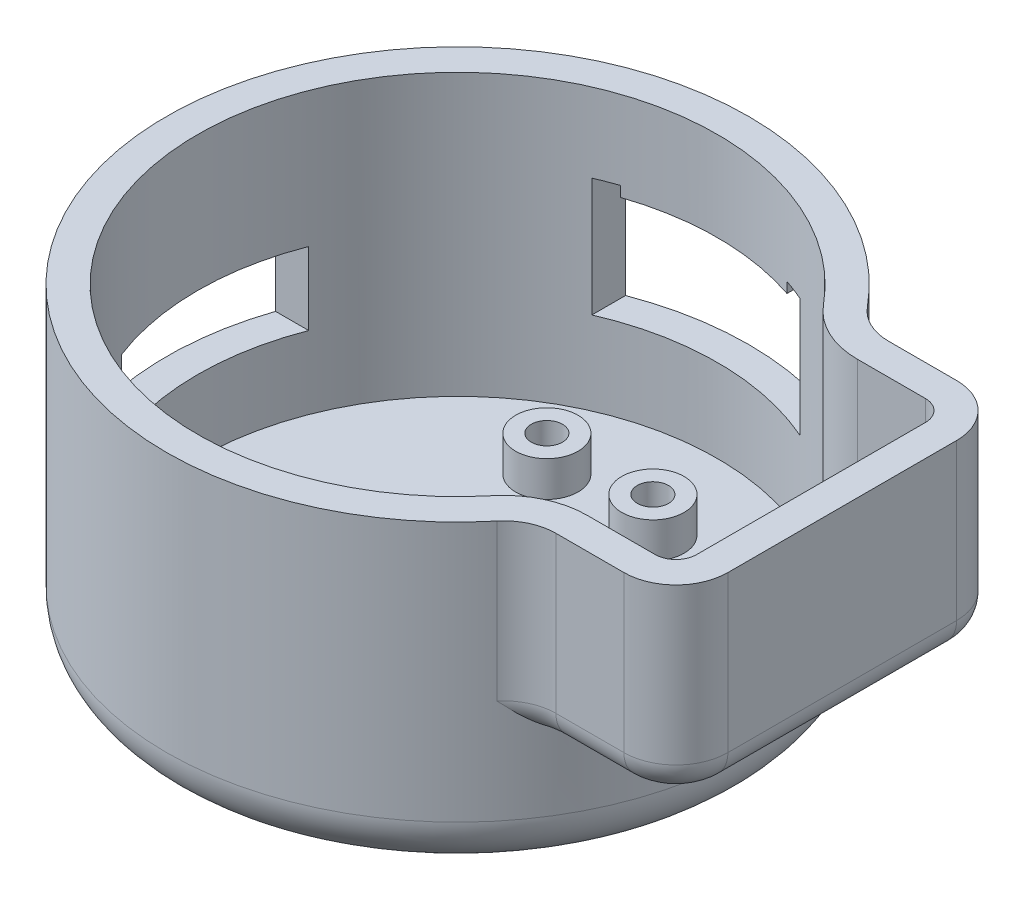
ISO-10303-21;
HEADER;
FILE_DESCRIPTION(('STEP AP214'),'2;1');
FILE_NAME('part.step','',(''),(''),'','','');
FILE_SCHEMA(('AUTOMOTIVE_DESIGN { 1 0 10303 214 1 1 1 1 }'));
ENDSEC;
DATA;
#1=APPLICATION_CONTEXT('core data for automotive mechanical design processes');
#2=APPLICATION_PROTOCOL_DEFINITION('international standard','automotive_design',2000,#1);
#3=PRODUCT_CONTEXT('',#1,'mechanical');
#4=PRODUCT('Part','Part','',(#3));
#5=PRODUCT_RELATED_PRODUCT_CATEGORY('part','',(#4));
#6=PRODUCT_DEFINITION_FORMATION('','',#4);
#7=PRODUCT_DEFINITION_CONTEXT('part definition',#1,'design');
#8=PRODUCT_DEFINITION('design','',#6,#7);
#9=PRODUCT_DEFINITION_SHAPE('','',#8);
#10=(LENGTH_UNIT() NAMED_UNIT(*) SI_UNIT(.MILLI.,.METRE.));
#11=(NAMED_UNIT(*) PLANE_ANGLE_UNIT() SI_UNIT($,.RADIAN.));
#12=(NAMED_UNIT(*) SI_UNIT($,.STERADIAN.) SOLID_ANGLE_UNIT());
#13=UNCERTAINTY_MEASURE_WITH_UNIT(LENGTH_MEASURE(1.E-05),#10,'distance_accuracy_value','');
#14=(GEOMETRIC_REPRESENTATION_CONTEXT(3) GLOBAL_UNCERTAINTY_ASSIGNED_CONTEXT((#13)) GLOBAL_UNIT_ASSIGNED_CONTEXT((#10,
#11,#12)) REPRESENTATION_CONTEXT('',''));
#15=CARTESIAN_POINT('',(0.,0.,0.));
#16=DIRECTION('',(0.,0.,1.));
#17=DIRECTION('',(1.,0.,0.));
#18=AXIS2_PLACEMENT_3D('',#15,#16,#17);
#19=CARTESIAN_POINT('',(0.,15.,0.));
#20=DIRECTION('',(0.,1.,0.));
#21=DIRECTION('',(0.,0.,1.));
#22=AXIS2_PLACEMENT_3D('',#19,#20,#21);
#23=PLANE('',#22);
#24=DIRECTION('',(1.,0.,0.));
#25=VECTOR('',#24,1.);
#26=CARTESIAN_POINT('',(9.5,15.,8.));
#27=LINE('',#26,#25);
#28=CARTESIAN_POINT('',(12.7279220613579,15.,8.));
#29=VERTEX_POINT('',#28);
#30=CARTESIAN_POINT('',(16.,15.,8.));
#31=VERTEX_POINT('',#30);
#32=EDGE_CURVE('E789',#29,#31,#27,.T.);
#33=ORIENTED_EDGE('',*,*,#32,.T.);
#34=CARTESIAN_POINT('',(16.,15.,5.5));
#35=DIRECTION('',(0.,1.,0.));
#36=DIRECTION('',(0.,0.,1.));
#37=AXIS2_PLACEMENT_3D('',#34,#35,#36);
#38=CIRCLE('',#37,2.5);
#39=CARTESIAN_POINT('',(18.5,15.,5.5));
#40=VERTEX_POINT('',#39);
#41=EDGE_CURVE('E815',#31,#40,#38,.T.);
#42=ORIENTED_EDGE('',*,*,#41,.T.);
#43=DIRECTION('',(0.,0.,-1.));
#44=VECTOR('',#43,1.);
#45=CARTESIAN_POINT('',(18.5,15.,-8.));
#46=LINE('',#45,#44);
#47=CARTESIAN_POINT('',(18.5,15.,-5.5));
#48=VERTEX_POINT('',#47);
#49=EDGE_CURVE('E770',#40,#48,#46,.T.);
#50=ORIENTED_EDGE('',*,*,#49,.T.);
#51=CARTESIAN_POINT('',(16.,15.,-5.5));
#52=DIRECTION('',(0.,1.,0.));
#53=DIRECTION('',(0.,0.,1.));
#54=AXIS2_PLACEMENT_3D('',#51,#52,#53);
#55=CIRCLE('',#54,2.5);
#56=CARTESIAN_POINT('',(16.,15.,-8.));
#57=VERTEX_POINT('',#56);
#58=EDGE_CURVE('E813',#48,#57,#55,.T.);
#59=ORIENTED_EDGE('',*,*,#58,.T.);
#60=DIRECTION('',(-1.,0.,0.));
#61=VECTOR('',#60,1.);
#62=CARTESIAN_POINT('',(9.5,15.,-8.));
#63=LINE('',#62,#61);
#64=CARTESIAN_POINT('',(12.7279220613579,15.,-8.));
#65=VERTEX_POINT('',#64);
#66=EDGE_CURVE('E786',#57,#65,#63,.T.);
#67=ORIENTED_EDGE('',*,*,#66,.T.);
#68=CARTESIAN_POINT('',(12.7279220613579,15.,-10.5));
#69=DIRECTION('',(0.,1.,0.));
#70=DIRECTION('',(0.,0.,1.));
#71=AXIS2_PLACEMENT_3D('',#68,#69,#70);
#72=CIRCLE('',#71,2.5);
#73=CARTESIAN_POINT('',(10.7994490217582,15.,-8.90909090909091));
#74=VERTEX_POINT('',#73);
#75=EDGE_CURVE('E809',#65,#74,#72,.F.);
#76=ORIENTED_EDGE('',*,*,#75,.T.);
#77=CARTESIAN_POINT('',(0.,15.,0.));
#78=DIRECTION('',(0.,1.,0.));
#79=DIRECTION('',(0.,0.,1.));
#80=AXIS2_PLACEMENT_3D('',#77,#78,#79);
#81=CIRCLE('',#80,14.);
#82=CARTESIAN_POINT('',(10.7994490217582,15.,8.90909090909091));
#83=VERTEX_POINT('',#82);
#84=EDGE_CURVE('E792',#74,#83,#81,.T.);
#85=ORIENTED_EDGE('',*,*,#84,.T.);
#86=CARTESIAN_POINT('',(12.7279220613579,15.,10.5));
#87=DIRECTION('',(0.,1.,0.));
#88=DIRECTION('',(0.,0.,1.));
#89=AXIS2_PLACEMENT_3D('',#86,#87,#88);
#90=CIRCLE('',#89,2.5);
#91=EDGE_CURVE('E807',#83,#29,#90,.F.);
#92=ORIENTED_EDGE('',*,*,#91,.T.);
#93=EDGE_LOOP('',(#33,#42,#50,#59,#67,#76,#85,#92));
#94=FACE_BOUND('',#93,.T.);
#95=DIRECTION('',(1.,0.,0.));
#96=VECTOR('',#95,1.);
#97=CARTESIAN_POINT('',(0.,15.,6.5));
#98=LINE('',#97,#96);
#99=CARTESIAN_POINT('',(12.7279220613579,15.,6.5));
#100=VERTEX_POINT('',#99);
#101=CARTESIAN_POINT('',(16.,15.,6.5));
#102=VERTEX_POINT('',#101);
#103=EDGE_CURVE('E742',#100,#102,#98,.T.);
#104=ORIENTED_EDGE('',*,*,#103,.F.);
#105=CARTESIAN_POINT('',(12.7279220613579,15.,10.5));
#106=DIRECTION('',(0.,1.,0.));
#107=DIRECTION('',(0.,0.,1.));
#108=AXIS2_PLACEMENT_3D('',#105,#106,#107);
#109=CIRCLE('',#108,4.);
#110=CARTESIAN_POINT('',(9.64236519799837,15.,7.95454545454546));
#111=VERTEX_POINT('',#110);
#112=EDGE_CURVE('E753',#111,#100,#109,.F.);
#113=ORIENTED_EDGE('',*,*,#112,.F.);
#114=CARTESIAN_POINT('',(0.,15.,0.));
#115=DIRECTION('',(0.,1.,0.));
#116=DIRECTION('',(0.,0.,1.));
#117=AXIS2_PLACEMENT_3D('',#114,#115,#116);
#118=CIRCLE('',#117,12.5);
#119=CARTESIAN_POINT('',(9.64236519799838,15.,-7.95454545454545));
#120=VERTEX_POINT('',#119);
#121=EDGE_CURVE('E727',#120,#111,#118,.T.);
#122=ORIENTED_EDGE('',*,*,#121,.F.);
#123=CARTESIAN_POINT('',(12.7279220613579,15.,-10.5));
#124=DIRECTION('',(0.,1.,0.));
#125=DIRECTION('',(0.,0.,1.));
#126=AXIS2_PLACEMENT_3D('',#123,#124,#125);
#127=CIRCLE('',#126,4.);
#128=CARTESIAN_POINT('',(12.7279220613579,15.,-6.5));
#129=VERTEX_POINT('',#128);
#130=EDGE_CURVE('E756',#129,#120,#127,.F.);
#131=ORIENTED_EDGE('',*,*,#130,.F.);
#132=DIRECTION('',(-1.,0.,0.));
#133=VECTOR('',#132,1.);
#134=CARTESIAN_POINT('',(0.,15.,-6.5));
#135=LINE('',#134,#133);
#136=CARTESIAN_POINT('',(16.,15.,-6.5));
#137=VERTEX_POINT('',#136);
#138=EDGE_CURVE('E777',#137,#129,#135,.T.);
#139=ORIENTED_EDGE('',*,*,#138,.F.);
#140=CARTESIAN_POINT('',(16.,15.,-5.5));
#141=DIRECTION('',(0.,1.,0.));
#142=DIRECTION('',(0.,0.,1.));
#143=AXIS2_PLACEMENT_3D('',#140,#141,#142);
#144=CIRCLE('',#143,1.);
#145=CARTESIAN_POINT('',(17.,15.,-5.5));
#146=VERTEX_POINT('',#145);
#147=EDGE_CURVE('E762',#146,#137,#144,.T.);
#148=ORIENTED_EDGE('',*,*,#147,.F.);
#149=DIRECTION('',(0.,0.,-1.));
#150=VECTOR('',#149,1.);
#151=CARTESIAN_POINT('',(17.,15.,0.));
#152=LINE('',#151,#150);
#153=CARTESIAN_POINT('',(17.,15.,5.5));
#154=VERTEX_POINT('',#153);
#155=EDGE_CURVE('E717',#154,#146,#152,.T.);
#156=ORIENTED_EDGE('',*,*,#155,.F.);
#157=CARTESIAN_POINT('',(16.,15.,5.5));
#158=DIRECTION('',(0.,1.,0.));
#159=DIRECTION('',(0.,0.,1.));
#160=AXIS2_PLACEMENT_3D('',#157,#158,#159);
#161=CIRCLE('',#160,1.);
#162=EDGE_CURVE('E768',#102,#154,#161,.T.);
#163=ORIENTED_EDGE('',*,*,#162,.F.);
#164=EDGE_LOOP('',(#104,#113,#122,#131,#139,#148,#156,#163));
#165=FACE_BOUND('',#164,.T.);
#166=ADVANCED_FACE('F35',(#94,#165),#23,.T.);
#167=CARTESIAN_POINT('',(0.,15.,0.));
#168=DIRECTION('',(0.,-1.,0.));
#169=DIRECTION('',(0.,0.,-1.));
#170=AXIS2_PLACEMENT_3D('',#167,#168,#169);
#171=CYLINDRICAL_SURFACE('',#170,14.);
#172=CARTESIAN_POINT('',(0.,2.5,0.));
#173=DIRECTION('',(0.,1.,0.));
#174=DIRECTION('',(0.,0.,1.));
#175=AXIS2_PLACEMENT_3D('',#172,#173,#174);
#176=CIRCLE('',#175,14.);
#177=CARTESIAN_POINT('',(0.,2.5,14.));
#178=VERTEX_POINT('',#177);
#179=EDGE_CURVE('E863',#178,#178,#176,.T.);
#180=ORIENTED_EDGE('',*,*,#179,.T.);
#181=EDGE_LOOP('',(#180));
#182=FACE_BOUND('',#181,.T.);
#183=DIRECTION('',(0.,-1.,0.));
#184=VECTOR('',#183,1.);
#185=CARTESIAN_POINT('',(-13.2570735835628,15.,4.5));
#186=LINE('',#185,#184);
#187=CARTESIAN_POINT('',(-13.2570735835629,8.5,4.5));
#188=VERTEX_POINT('',#187);
#189=CARTESIAN_POINT('',(-13.2570735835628,5.,4.5));
#190=VERTEX_POINT('',#189);
#191=EDGE_CURVE('E638',#188,#190,#186,.T.);
#192=ORIENTED_EDGE('',*,*,#191,.T.);
#193=CARTESIAN_POINT('',(0.,5.,0.));
#194=DIRECTION('',(0.,-1.,0.));
#195=DIRECTION('',(0.,0.,-1.));
#196=AXIS2_PLACEMENT_3D('',#193,#194,#195);
#197=CIRCLE('',#196,14.);
#198=CARTESIAN_POINT('',(-13.2570735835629,5.,-4.5));
#199=VERTEX_POINT('',#198);
#200=EDGE_CURVE('E641',#190,#199,#197,.T.);
#201=ORIENTED_EDGE('',*,*,#200,.T.);
#202=DIRECTION('',(0.,-1.,0.));
#203=VECTOR('',#202,1.);
#204=CARTESIAN_POINT('',(-13.2570735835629,15.,-4.5));
#205=LINE('',#204,#203);
#206=CARTESIAN_POINT('',(-13.2570735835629,8.5,-4.5));
#207=VERTEX_POINT('',#206);
#208=EDGE_CURVE('E625',#199,#207,#205,.F.);
#209=ORIENTED_EDGE('',*,*,#208,.T.);
#210=CARTESIAN_POINT('',(0.,8.5,0.));
#211=DIRECTION('',(0.,1.,0.));
#212=DIRECTION('',(0.,0.,1.));
#213=AXIS2_PLACEMENT_3D('',#210,#211,#212);
#214=CIRCLE('',#213,14.);
#215=EDGE_CURVE('E635',#207,#188,#214,.T.);
#216=ORIENTED_EDGE('',*,*,#215,.T.);
#217=EDGE_LOOP('',(#192,#201,#209,#216));
#218=FACE_BOUND('',#217,.T.);
#219=DIRECTION('',(0.,-1.,0.));
#220=VECTOR('',#219,1.);
#221=CARTESIAN_POINT('',(-5.,15.,-13.076696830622));
#222=LINE('',#221,#220);
#223=CARTESIAN_POINT('',(-5.,11.2,-13.076696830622));
#224=VERTEX_POINT('',#223);
#225=CARTESIAN_POINT('',(-5.,5.5,-13.076696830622));
#226=VERTEX_POINT('',#225);
#227=EDGE_CURVE('E685',#224,#226,#222,.T.);
#228=ORIENTED_EDGE('',*,*,#227,.T.);
#229=CARTESIAN_POINT('',(0.,5.5,0.));
#230=DIRECTION('',(0.,-1.,0.));
#231=DIRECTION('',(0.,0.,-1.));
#232=AXIS2_PLACEMENT_3D('',#229,#230,#231);
#233=CIRCLE('',#232,14.);
#234=CARTESIAN_POINT('',(5.,5.5,-13.076696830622));
#235=VERTEX_POINT('',#234);
#236=EDGE_CURVE('E688',#226,#235,#233,.T.);
#237=ORIENTED_EDGE('',*,*,#236,.T.);
#238=DIRECTION('',(0.,-1.,0.));
#239=VECTOR('',#238,1.);
#240=CARTESIAN_POINT('',(4.99999999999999,15.,-13.076696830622));
#241=LINE('',#240,#239);
#242=CARTESIAN_POINT('',(4.99999999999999,11.2,-13.076696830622));
#243=VERTEX_POINT('',#242);
#244=EDGE_CURVE('E647',#235,#243,#241,.F.);
#245=ORIENTED_EDGE('',*,*,#244,.T.);
#246=CARTESIAN_POINT('',(0.,11.2,0.));
#247=DIRECTION('',(0.,1.,0.));
#248=DIRECTION('',(0.,0.,1.));
#249=AXIS2_PLACEMENT_3D('',#246,#247,#248);
#250=CIRCLE('',#249,14.);
#251=CARTESIAN_POINT('',(4.,11.2,-13.4164078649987));
#252=VERTEX_POINT('',#251);
#253=EDGE_CURVE('E670',#243,#252,#250,.T.);
#254=ORIENTED_EDGE('',*,*,#253,.T.);
#255=DIRECTION('',(0.,-1.,0.));
#256=VECTOR('',#255,1.);
#257=CARTESIAN_POINT('',(4.,15.,-13.4164078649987));
#258=LINE('',#257,#256);
#259=CARTESIAN_POINT('',(4.,10.7,-13.4164078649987));
#260=VERTEX_POINT('',#259);
#261=EDGE_CURVE('E673',#252,#260,#258,.T.);
#262=ORIENTED_EDGE('',*,*,#261,.T.);
#263=CARTESIAN_POINT('',(0.,10.7,0.));
#264=DIRECTION('',(0.,1.,0.));
#265=DIRECTION('',(0.,0.,1.));
#266=AXIS2_PLACEMENT_3D('',#263,#264,#265);
#267=CIRCLE('',#266,14.);
#268=CARTESIAN_POINT('',(-4.,10.7,-13.4164078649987));
#269=VERTEX_POINT('',#268);
#270=EDGE_CURVE('E676',#260,#269,#267,.T.);
#271=ORIENTED_EDGE('',*,*,#270,.T.);
#272=DIRECTION('',(0.,-1.,0.));
#273=VECTOR('',#272,1.);
#274=CARTESIAN_POINT('',(-4.,15.,-13.4164078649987));
#275=LINE('',#274,#273);
#276=CARTESIAN_POINT('',(-4.,11.2,-13.4164078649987));
#277=VERTEX_POINT('',#276);
#278=EDGE_CURVE('E679',#269,#277,#275,.F.);
#279=ORIENTED_EDGE('',*,*,#278,.T.);
#280=CARTESIAN_POINT('',(0.,11.2,0.));
#281=DIRECTION('',(0.,1.,0.));
#282=DIRECTION('',(-1.,0.,0.));
#283=AXIS2_PLACEMENT_3D('',#280,#281,#282);
#284=CIRCLE('',#283,14.);
#285=EDGE_CURVE('E682',#277,#224,#284,.T.);
#286=ORIENTED_EDGE('',*,*,#285,.T.);
#287=EDGE_LOOP('',(#228,#237,#245,#254,#262,#271,#279,#286));
#288=FACE_BOUND('',#287,.T.);
#289=CARTESIAN_POINT('',(0.,6.,0.));
#290=DIRECTION('',(0.,1.,0.));
#291=DIRECTION('',(0.,0.,1.));
#292=AXIS2_PLACEMENT_3D('',#289,#290,#291);
#293=CIRCLE('',#292,14.);
#294=CARTESIAN_POINT('',(12.3921874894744,6.,6.51411461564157));
#295=VERTEX_POINT('',#294);
#296=CARTESIAN_POINT('',(12.3921874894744,6.,-6.51411461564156));
#297=VERTEX_POINT('',#296);
#298=EDGE_CURVE('E795',#295,#297,#293,.T.);
#299=ORIENTED_EDGE('',*,*,#298,.F.);
#300=CARTESIAN_POINT('',(12.3921874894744,6.,6.51411461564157));
#301=CARTESIAN_POINT('',(12.3324839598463,5.99999803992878,6.62777265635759));
#302=CARTESIAN_POINT('',(12.2714614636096,6.01167979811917,6.73998706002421));
#303=CARTESIAN_POINT('',(12.1487791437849,6.0542592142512,6.9586208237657));
#304=CARTESIAN_POINT('',(12.0871359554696,6.08492274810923,7.0650938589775));
#305=CARTESIAN_POINT('',(11.9261745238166,6.18479147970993,7.33512977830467));
#306=CARTESIAN_POINT('',(11.8267442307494,6.26609504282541,7.49403022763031));
#307=CARTESIAN_POINT('',(11.6291049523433,6.45502141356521,7.79724646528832));
#308=CARTESIAN_POINT('',(11.5309098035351,6.56282844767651,7.9414497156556));
#309=CARTESIAN_POINT('',(11.3285144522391,6.80285431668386,8.22786977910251));
#310=CARTESIAN_POINT('',(11.224426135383,6.93630673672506,8.3690997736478));
#311=CARTESIAN_POINT('',(11.0156270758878,7.21119416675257,8.6420740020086));
#312=CARTESIAN_POINT('',(10.9109178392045,7.35261396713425,8.77383528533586));
#313=CARTESIAN_POINT('',(10.802439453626,7.49604770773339,8.90546501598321));
#314=CARTESIAN_POINT('',(10.8009444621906,7.49802385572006,8.90727814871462));
#315=CARTESIAN_POINT('',(10.7994490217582,7.5,8.90909090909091));
#316=B_SPLINE_CURVE_WITH_KNOTS('',3,(#300,#301,#302,#303,#304,#305,#306,#307,#308,#309,#310,
#311,#312,#313,#314,#315),.UNSPECIFIED.,.F.,.F.,(4,2,2,2,2,2,2,4),(0.,0.383638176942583,
0.762636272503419,1.37213752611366,1.98600156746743,2.6465944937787,3.305966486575,
3.31517781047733),.UNSPECIFIED.);
#317=CARTESIAN_POINT('',(10.7994490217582,7.5,8.90909090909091));
#318=VERTEX_POINT('',#317);
#319=EDGE_CURVE('E45',#295,#318,#316,.T.);
#320=ORIENTED_EDGE('',*,*,#319,.T.);
#321=DIRECTION('',(0.,-1.,0.));
#322=VECTOR('',#321,1.);
#323=CARTESIAN_POINT('',(10.7994490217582,15.,8.90909090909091));
#324=LINE('',#323,#322);
#325=EDGE_CURVE('E800',#318,#83,#324,.F.);
#326=ORIENTED_EDGE('',*,*,#325,.T.);
#327=ORIENTED_EDGE('',*,*,#84,.F.);
#328=DIRECTION('',(0.,-1.,0.));
#329=VECTOR('',#328,1.);
#330=CARTESIAN_POINT('',(10.7994490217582,15.,-8.90909090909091));
#331=LINE('',#330,#329);
#332=CARTESIAN_POINT('',(10.7994490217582,7.5,-8.90909090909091));
#333=VERTEX_POINT('',#332);
#334=EDGE_CURVE('E798',#74,#333,#331,.T.);
#335=ORIENTED_EDGE('',*,*,#334,.T.);
#336=CARTESIAN_POINT('',(12.3921874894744,6.,-6.51411461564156));
#337=CARTESIAN_POINT('',(12.3324839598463,5.99999803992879,-6.62777265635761));
#338=CARTESIAN_POINT('',(12.2714614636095,6.01167979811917,-6.73998706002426));
#339=CARTESIAN_POINT('',(12.1487791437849,6.05425921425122,-6.95862082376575));
#340=CARTESIAN_POINT('',(12.0871359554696,6.08492274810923,-7.06509385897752));
#341=CARTESIAN_POINT('',(11.9261745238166,6.18479147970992,-7.33512977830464));
#342=CARTESIAN_POINT('',(11.8267442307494,6.26609504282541,-7.49403022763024));
#343=CARTESIAN_POINT('',(11.6291049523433,6.45502141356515,-7.79724646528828));
#344=CARTESIAN_POINT('',(11.5309098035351,6.5628284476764,-7.94144971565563));
#345=CARTESIAN_POINT('',(11.3285144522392,6.80285431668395,-8.22786977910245));
#346=CARTESIAN_POINT('',(11.2244261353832,6.93630673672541,-8.36909977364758));
#347=CARTESIAN_POINT('',(11.0156270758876,7.21119416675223,-8.64207400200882));
#348=CARTESIAN_POINT('',(10.9109178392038,7.35261396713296,-8.77383528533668));
#349=CARTESIAN_POINT('',(10.802439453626,7.49604770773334,-8.90546501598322));
#350=CARTESIAN_POINT('',(10.8009444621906,7.49802385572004,-8.90727814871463));
#351=CARTESIAN_POINT('',(10.7994490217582,7.5,-8.90909090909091));
#352=B_SPLINE_CURVE_WITH_KNOTS('',3,(#336,#337,#338,#339,#340,#341,#342,#343,#344,#345,#346,
#347,#348,#349,#350,#351),.UNSPECIFIED.,.F.,.F.,(4,2,2,2,2,2,2,4),(0.,0.383638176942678,
0.762636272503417,1.37213752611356,1.98600156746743,2.64659449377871,3.30596648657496,
3.31517781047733),.UNSPECIFIED.);
#353=EDGE_CURVE('E11',#333,#297,#352,.F.);
#354=ORIENTED_EDGE('',*,*,#353,.T.);
#355=EDGE_LOOP('',(#299,#320,#326,#327,#335,#354));
#356=FACE_BOUND('',#355,.T.);
#357=ADVANCED_FACE('F908',(#182,#218,#288,#356),#171,.T.);
#358=CARTESIAN_POINT('',(0.,0.,0.));
#359=DIRECTION('',(0.,1.,0.));
#360=DIRECTION('',(0.,0.,1.));
#361=AXIS2_PLACEMENT_3D('',#358,#359,#360);
#362=PLANE('',#361);
#363=DIRECTION('',(-0.798426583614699,0.,0.602092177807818));
#364=VECTOR('',#363,1.);
#365=CARTESIAN_POINT('',(2.33533454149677,0.,-9.82786105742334));
#366=LINE('',#365,#364);
#367=CARTESIAN_POINT('',(2.33533454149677,0.,-9.82786105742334));
#368=VERTEX_POINT('',#367);
#369=CARTESIAN_POINT('',(-0.386785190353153,0.,-7.77511503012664));
#370=VERTEX_POINT('',#369);
#371=EDGE_CURVE('E485',#368,#370,#366,.T.);
#372=ORIENTED_EDGE('',*,*,#371,.F.);
#373=DIRECTION('',(0.,0.,1.));
#374=VECTOR('',#373,1.);
#375=CARTESIAN_POINT('',(2.33533454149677,0.,-9.82786105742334));
#376=LINE('',#375,#374);
#377=CARTESIAN_POINT('',(2.33533454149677,0.,-11.0803243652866));
#378=VERTEX_POINT('',#377);
#379=EDGE_CURVE('E53',#378,#368,#376,.T.);
#380=ORIENTED_EDGE('',*,*,#379,.F.);
#381=DIRECTION('',(0.798426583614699,0.,-0.602092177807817));
#382=VECTOR('',#381,1.);
#383=CARTESIAN_POINT('',(1.73324236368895,0.,-10.626287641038));
#384=LINE('',#383,#382);
#385=CARTESIAN_POINT('',(-2.18280525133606,0.,-7.67320255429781));
#386=VERTEX_POINT('',#385);
#387=EDGE_CURVE('E425',#386,#378,#384,.T.);
#388=ORIENTED_EDGE('',*,*,#387,.F.);
#389=DIRECTION('',(-0.861411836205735,0.,-0.50790712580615));
#390=VECTOR('',#389,1.);
#391=CARTESIAN_POINT('',(-2.18280525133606,0.,-7.67320255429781));
#392=LINE('',#391,#390);
#393=CARTESIAN_POINT('',(0.983547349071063,0.,-5.80625229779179));
#394=VERTEX_POINT('',#393);
#395=EDGE_CURVE('E428',#394,#386,#392,.T.);
#396=ORIENTED_EDGE('',*,*,#395,.F.);
#397=DIRECTION('',(0.830976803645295,0.,-0.55630706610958));
#398=VECTOR('',#397,1.);
#399=CARTESIAN_POINT('',(0.983547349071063,0.,-5.80625229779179));
#400=LINE('',#399,#398);
#401=CARTESIAN_POINT('',(-2.75628388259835,0.,-3.30257887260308));
#402=VERTEX_POINT('',#401);
#403=EDGE_CURVE('E538',#402,#394,#400,.T.);
#404=ORIENTED_EDGE('',*,*,#403,.F.);
#405=DIRECTION('',(-0.912480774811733,0.,-0.409119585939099));
#406=VECTOR('',#405,1.);
#407=CARTESIAN_POINT('',(-2.75628388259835,0.,-3.30257887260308));
#408=LINE('',#407,#406);
#409=CARTESIAN_POINT('',(0.836820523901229,0.,-1.69157573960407));
#410=VERTEX_POINT('',#409);
#411=EDGE_CURVE('E535',#410,#402,#408,.T.);
#412=ORIENTED_EDGE('',*,*,#411,.F.);
#413=DIRECTION('',(0.934512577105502,0.,-0.355930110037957));
#414=VECTOR('',#413,1.);
#415=CARTESIAN_POINT('',(0.836820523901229,0.,-1.69157573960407));
#416=LINE('',#415,#414);
#417=CARTESIAN_POINT('',(-10.1712494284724,0.,2.50109501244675));
#418=VERTEX_POINT('',#417);
#419=EDGE_CURVE('E532',#418,#410,#416,.T.);
#420=ORIENTED_EDGE('',*,*,#419,.F.);
#421=DIRECTION('',(-0.978482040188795,0.,-0.206332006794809));
#422=VECTOR('',#421,1.);
#423=CARTESIAN_POINT('',(-10.1712494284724,0.,2.50109501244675));
#424=LINE('',#423,#422);
#425=CARTESIAN_POINT('',(4.47089742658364,0.,5.5886770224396));
#426=VERTEX_POINT('',#425);
#427=EDGE_CURVE('E529',#426,#418,#424,.T.);
#428=ORIENTED_EDGE('',*,*,#427,.F.);
#429=DIRECTION('',(0.934512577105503,0.,-0.355930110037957));
#430=VECTOR('',#429,1.);
#431=CARTESIAN_POINT('',(4.47089742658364,0.,5.5886770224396));
#432=LINE('',#431,#430);
#433=CARTESIAN_POINT('',(0.52937549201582,0.,7.08989420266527));
#434=VERTEX_POINT('',#433);
#435=EDGE_CURVE('E526',#434,#426,#432,.T.);
#436=ORIENTED_EDGE('',*,*,#435,.F.);
#437=DIRECTION('',(-0.912480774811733,0.,-0.409119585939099));
#438=VECTOR('',#437,1.);
#439=CARTESIAN_POINT('',(0.52937549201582,0.,7.08989420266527));
#440=LINE('',#439,#438);
#441=CARTESIAN_POINT('',(3.21127978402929,0.,8.29235194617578));
#442=VERTEX_POINT('',#441);
#443=EDGE_CURVE('E523',#442,#434,#440,.T.);
#444=ORIENTED_EDGE('',*,*,#443,.F.);
#445=DIRECTION('',(0.858508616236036,0.,-0.512799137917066));
#446=VECTOR('',#445,1.);
#447=CARTESIAN_POINT('',(3.21127978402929,0.,8.29235194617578));
#448=LINE('',#447,#446);
#449=CARTESIAN_POINT('',(1.33487898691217,0.,9.41315224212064));
#450=VERTEX_POINT('',#449);
#451=EDGE_CURVE('E520',#450,#442,#448,.T.);
#452=ORIENTED_EDGE('',*,*,#451,.F.);
#453=DIRECTION('',(-0.87335138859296,0.,-0.487090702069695));
#454=VECTOR('',#453,1.);
#455=CARTESIAN_POINT('',(1.33487898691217,0.,9.41315224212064));
#456=LINE('',#455,#454);
#457=CARTESIAN_POINT('',(3.81531258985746,0.,10.7965543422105));
#458=VERTEX_POINT('',#457);
#459=EDGE_CURVE('E517',#458,#450,#456,.T.);
#460=ORIENTED_EDGE('',*,*,#459,.F.);
#461=DIRECTION('',(0.,0.,1.));
#462=VECTOR('',#461,1.);
#463=CARTESIAN_POINT('',(3.81531258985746,0.,10.7965543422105));
#464=LINE('',#463,#462);
#465=CARTESIAN_POINT('',(3.81531258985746,0.,9.65153984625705));
#466=VERTEX_POINT('',#465);
#467=EDGE_CURVE('E514',#466,#458,#464,.T.);
#468=ORIENTED_EDGE('',*,*,#467,.F.);
#469=DIRECTION('',(0.87335138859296,0.,0.487090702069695));
#470=VECTOR('',#469,1.);
#471=CARTESIAN_POINT('',(3.403546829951,0.,9.42188741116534));
#472=LINE('',#471,#470);
#473=CARTESIAN_POINT('',(3.33465866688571,0.,9.38346669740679));
#474=VERTEX_POINT('',#473);
#475=EDGE_CURVE('E511',#474,#466,#472,.T.);
#476=ORIENTED_EDGE('',*,*,#475,.F.);
#477=DIRECTION('',(-0.858508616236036,0.,0.512799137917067));
#478=VECTOR('',#477,1.);
#479=CARTESIAN_POINT('',(5.37325862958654,0.,8.16578258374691));
#480=LINE('',#479,#478);
#481=CARTESIAN_POINT('',(5.37325862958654,0.,8.16578258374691));
#482=VERTEX_POINT('',#481);
#483=EDGE_CURVE('E508',#482,#474,#480,.T.);
#484=ORIENTED_EDGE('',*,*,#483,.F.);
#485=DIRECTION('',(0.912480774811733,0.,0.409119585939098));
#486=VECTOR('',#485,1.);
#487=CARTESIAN_POINT('',(3.14141853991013,0.,7.16511548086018));
#488=LINE('',#487,#486);
#489=CARTESIAN_POINT('',(3.14141853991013,0.,7.16511548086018));
#490=VERTEX_POINT('',#489);
#491=EDGE_CURVE('E505',#490,#482,#488,.T.);
#492=ORIENTED_EDGE('',*,*,#491,.F.);
#493=DIRECTION('',(-0.934512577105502,0.,0.355930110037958));
#494=VECTOR('',#493,1.);
#495=CARTESIAN_POINT('',(8.00633665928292,0.,5.3122021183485));
#496=LINE('',#495,#494);
#497=CARTESIAN_POINT('',(8.00633665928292,0.,5.3122021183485));
#498=VERTEX_POINT('',#497);
#499=EDGE_CURVE('E502',#498,#490,#496,.T.);
#500=ORIENTED_EDGE('',*,*,#499,.F.);
#501=DIRECTION('',(0.978482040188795,0.,0.206332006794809));
#502=VECTOR('',#501,1.);
#503=CARTESIAN_POINT('',(-6.63581019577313,0.,2.22462010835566));
#504=LINE('',#503,#502);
#505=CARTESIAN_POINT('',(-6.63581019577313,0.,2.22462010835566));
#506=VERTEX_POINT('',#505);
#507=EDGE_CURVE('E499',#506,#498,#504,.T.);
#508=ORIENTED_EDGE('',*,*,#507,.F.);
#509=DIRECTION('',(-0.934512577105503,0.,0.355930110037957));
#510=VECTOR('',#509,1.);
#511=CARTESIAN_POINT('',(3.44886357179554,0.,-1.61635446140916));
#512=LINE('',#511,#510);
#513=CARTESIAN_POINT('',(3.44886357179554,0.,-1.61635446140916));
#514=VERTEX_POINT('',#513);
#515=EDGE_CURVE('E496',#514,#506,#512,.T.);
#516=ORIENTED_EDGE('',*,*,#515,.F.);
#517=DIRECTION('',(0.912480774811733,0.,0.409119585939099));
#518=VECTOR('',#517,1.);
#519=CARTESIAN_POINT('',(-0.699321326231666,0.,-3.47623330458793));
#520=LINE('',#519,#518);
#521=CARTESIAN_POINT('',(-0.699321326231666,0.,-3.47623330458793));
#522=VERTEX_POINT('',#521);
#523=EDGE_CURVE('E493',#522,#514,#520,.T.);
#524=ORIENTED_EDGE('',*,*,#523,.F.);
#525=DIRECTION('',(-0.830976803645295,0.,0.55630706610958));
#526=VECTOR('',#525,1.);
#527=CARTESIAN_POINT('',(2.86133247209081,0.,-5.8599543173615));
#528=LINE('',#527,#526);
#529=CARTESIAN_POINT('',(2.86133247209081,0.,-5.8599543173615));
#530=VERTEX_POINT('',#529);
#531=EDGE_CURVE('E490',#530,#522,#528,.T.);
#532=ORIENTED_EDGE('',*,*,#531,.F.);
#533=DIRECTION('',(0.861411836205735,0.,0.50790712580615));
#534=VECTOR('',#533,1.);
#535=CARTESIAN_POINT('',(-0.386785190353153,0.,-7.77511503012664));
#536=LINE('',#535,#534);
#537=EDGE_CURVE('E487',#370,#530,#536,.T.);
#538=ORIENTED_EDGE('',*,*,#537,.F.);
#539=EDGE_LOOP('',(#372,#380,#388,#396,#404,#412,#420,#428,#436,#444,#452,#460,#468,#476,#484,
#492,#500,#508,#516,#524,#532,#538));
#540=FACE_BOUND('',#539,.T.);
#541=CARTESIAN_POINT('',(0.,0.,0.));
#542=DIRECTION('',(0.,1.,0.));
#543=DIRECTION('',(0.,0.,1.));
#544=AXIS2_PLACEMENT_3D('',#541,#542,#543);
#545=CIRCLE('',#544,11.5);
#546=CARTESIAN_POINT('',(0.,0.,11.5));
#547=VERTEX_POINT('',#546);
#548=EDGE_CURVE('E866',#547,#547,#545,.F.);
#549=ORIENTED_EDGE('',*,*,#548,.T.);
#550=EDGE_LOOP('',(#549));
#551=FACE_BOUND('',#550,.T.);
#552=ADVANCED_FACE('F949',(#540,#551),#362,.F.);
#553=CARTESIAN_POINT('',(9.5,6.,8.));
#554=DIRECTION('',(0.,0.,1.));
#555=DIRECTION('',(1.,0.,0.));
#556=AXIS2_PLACEMENT_3D('',#553,#554,#555);
#557=PLANE('',#556);
#558=DIRECTION('',(0.,-1.,0.));
#559=VECTOR('',#558,1.);
#560=CARTESIAN_POINT('',(12.7279220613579,6.,8.));
#561=LINE('',#560,#559);
#562=CARTESIAN_POINT('',(12.7279220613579,7.5,8.));
#563=VERTEX_POINT('',#562);
#564=EDGE_CURVE('E802',#29,#563,#561,.T.);
#565=ORIENTED_EDGE('',*,*,#564,.T.);
#566=DIRECTION('',(1.,0.,0.));
#567=VECTOR('',#566,1.);
#568=CARTESIAN_POINT('',(16.,7.5,8.));
#569=LINE('',#568,#567);
#570=CARTESIAN_POINT('',(16.,7.5,8.));
#571=VERTEX_POINT('',#570);
#572=EDGE_CURVE('E886',#563,#571,#569,.T.);
#573=ORIENTED_EDGE('',*,*,#572,.T.);
#574=DIRECTION('',(0.,1.,0.));
#575=VECTOR('',#574,1.);
#576=CARTESIAN_POINT('',(16.,6.,8.));
#577=LINE('',#576,#575);
#578=EDGE_CURVE('E811',#571,#31,#577,.T.);
#579=ORIENTED_EDGE('',*,*,#578,.T.);
#580=ORIENTED_EDGE('',*,*,#32,.F.);
#581=EDGE_LOOP('',(#565,#573,#579,#580));
#582=FACE_BOUND('',#581,.T.);
#583=ADVANCED_FACE('F956',(#582),#557,.T.);
#584=CARTESIAN_POINT('',(9.5,6.,-8.));
#585=DIRECTION('',(0.,0.,-1.));
#586=DIRECTION('',(-1.,0.,0.));
#587=AXIS2_PLACEMENT_3D('',#584,#585,#586);
#588=PLANE('',#587);
#589=DIRECTION('',(0.,1.,0.));
#590=VECTOR('',#589,1.);
#591=CARTESIAN_POINT('',(16.,6.,-8.));
#592=LINE('',#591,#590);
#593=CARTESIAN_POINT('',(16.,7.5,-8.));
#594=VERTEX_POINT('',#593);
#595=EDGE_CURVE('E822',#57,#594,#592,.F.);
#596=ORIENTED_EDGE('',*,*,#595,.T.);
#597=DIRECTION('',(-1.,0.,0.));
#598=VECTOR('',#597,1.);
#599=CARTESIAN_POINT('',(12.7279220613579,7.5,-8.));
#600=LINE('',#599,#598);
#601=CARTESIAN_POINT('',(12.7279220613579,7.5,-8.));
#602=VERTEX_POINT('',#601);
#603=EDGE_CURVE('E894',#594,#602,#600,.T.);
#604=ORIENTED_EDGE('',*,*,#603,.T.);
#605=DIRECTION('',(0.,-1.,0.));
#606=VECTOR('',#605,1.);
#607=CARTESIAN_POINT('',(12.7279220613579,6.,-8.));
#608=LINE('',#607,#606);
#609=EDGE_CURVE('E805',#602,#65,#608,.F.);
#610=ORIENTED_EDGE('',*,*,#609,.T.);
#611=ORIENTED_EDGE('',*,*,#66,.F.);
#612=EDGE_LOOP('',(#596,#604,#610,#611));
#613=FACE_BOUND('',#612,.T.);
#614=ADVANCED_FACE('F961',(#613),#588,.T.);
#615=CARTESIAN_POINT('',(18.5,6.,-8.));
#616=DIRECTION('',(1.,0.,0.));
#617=DIRECTION('',(0.,0.,-1.));
#618=AXIS2_PLACEMENT_3D('',#615,#616,#617);
#619=PLANE('',#618);
#620=DIRECTION('',(0.,1.,0.));
#621=VECTOR('',#620,1.);
#622=CARTESIAN_POINT('',(18.5,6.,5.5));
#623=LINE('',#622,#621);
#624=CARTESIAN_POINT('',(18.5,7.5,5.5));
#625=VERTEX_POINT('',#624);
#626=EDGE_CURVE('E819',#40,#625,#623,.F.);
#627=ORIENTED_EDGE('',*,*,#626,.T.);
#628=DIRECTION('',(0.,0.,-1.));
#629=VECTOR('',#628,1.);
#630=CARTESIAN_POINT('',(18.5,7.5,-5.5));
#631=LINE('',#630,#629);
#632=CARTESIAN_POINT('',(18.5,7.5,-5.5));
#633=VERTEX_POINT('',#632);
#634=EDGE_CURVE('E890',#625,#633,#631,.T.);
#635=ORIENTED_EDGE('',*,*,#634,.T.);
#636=DIRECTION('',(0.,1.,0.));
#637=VECTOR('',#636,1.);
#638=CARTESIAN_POINT('',(18.5,6.,-5.5));
#639=LINE('',#638,#637);
#640=EDGE_CURVE('E817',#633,#48,#639,.T.);
#641=ORIENTED_EDGE('',*,*,#640,.T.);
#642=ORIENTED_EDGE('',*,*,#49,.F.);
#643=EDGE_LOOP('',(#627,#635,#641,#642));
#644=FACE_BOUND('',#643,.T.);
#645=ADVANCED_FACE('F953',(#644),#619,.T.);
#646=CARTESIAN_POINT('',(0.,6.,0.));
#647=DIRECTION('',(0.,1.,0.));
#648=DIRECTION('',(0.,0.,1.));
#649=AXIS2_PLACEMENT_3D('',#646,#647,#648);
#650=PLANE('',#649);
#651=DIRECTION('',(1.,0.,0.));
#652=VECTOR('',#651,1.);
#653=CARTESIAN_POINT('',(12.7279220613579,6.,6.5));
#654=LINE('',#653,#652);
#655=CARTESIAN_POINT('',(16.,6.,6.5));
#656=VERTEX_POINT('',#655);
#657=CARTESIAN_POINT('',(12.7279220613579,6.,6.5));
#658=VERTEX_POINT('',#657);
#659=EDGE_CURVE('E879',#656,#658,#654,.F.);
#660=ORIENTED_EDGE('',*,*,#659,.T.);
#661=CARTESIAN_POINT('',(12.7279220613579,6.,10.5));
#662=DIRECTION('',(0.,1.,0.));
#663=DIRECTION('',(0.,0.,1.));
#664=AXIS2_PLACEMENT_3D('',#661,#662,#663);
#665=CIRCLE('',#664,4.);
#666=EDGE_CURVE('E881',#658,#295,#665,.T.);
#667=ORIENTED_EDGE('',*,*,#666,.T.);
#668=ORIENTED_EDGE('',*,*,#298,.T.);
#669=CARTESIAN_POINT('',(12.7279220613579,6.,-10.5));
#670=DIRECTION('',(0.,1.,0.));
#671=DIRECTION('',(0.,0.,1.));
#672=AXIS2_PLACEMENT_3D('',#669,#670,#671);
#673=CIRCLE('',#672,4.);
#674=CARTESIAN_POINT('',(12.7279220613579,6.,-6.5));
#675=VERTEX_POINT('',#674);
#676=EDGE_CURVE('E869',#297,#675,#673,.T.);
#677=ORIENTED_EDGE('',*,*,#676,.T.);
#678=DIRECTION('',(-1.,0.,0.));
#679=VECTOR('',#678,1.);
#680=CARTESIAN_POINT('',(16.,6.,-6.5));
#681=LINE('',#680,#679);
#682=CARTESIAN_POINT('',(16.,6.,-6.5));
#683=VERTEX_POINT('',#682);
#684=EDGE_CURVE('E871',#675,#683,#681,.F.);
#685=ORIENTED_EDGE('',*,*,#684,.T.);
#686=CARTESIAN_POINT('',(16.,6.,-5.5));
#687=DIRECTION('',(0.,1.,0.));
#688=DIRECTION('',(0.,0.,1.));
#689=AXIS2_PLACEMENT_3D('',#686,#687,#688);
#690=CIRCLE('',#689,1.);
#691=CARTESIAN_POINT('',(17.,6.,-5.5));
#692=VERTEX_POINT('',#691);
#693=EDGE_CURVE('E873',#683,#692,#690,.F.);
#694=ORIENTED_EDGE('',*,*,#693,.T.);
#695=DIRECTION('',(0.,0.,-1.));
#696=VECTOR('',#695,1.);
#697=CARTESIAN_POINT('',(17.,6.,5.5));
#698=LINE('',#697,#696);
#699=CARTESIAN_POINT('',(17.,6.,5.5));
#700=VERTEX_POINT('',#699);
#701=EDGE_CURVE('E875',#692,#700,#698,.F.);
#702=ORIENTED_EDGE('',*,*,#701,.T.);
#703=CARTESIAN_POINT('',(16.,6.,5.5));
#704=DIRECTION('',(0.,1.,0.));
#705=DIRECTION('',(0.,0.,1.));
#706=AXIS2_PLACEMENT_3D('',#703,#704,#705);
#707=CIRCLE('',#706,1.);
#708=EDGE_CURVE('E877',#700,#656,#707,.F.);
#709=ORIENTED_EDGE('',*,*,#708,.T.);
#710=EDGE_LOOP('',(#660,#667,#668,#677,#685,#694,#702,#709));
#711=FACE_BOUND('',#710,.T.);
#712=ADVANCED_FACE('F980',(#711),#650,.F.);
#713=CARTESIAN_POINT('',(12.7279220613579,15.,10.5));
#714=DIRECTION('',(0.,-1.,0.));
#715=DIRECTION('',(0.,0.,-1.));
#716=AXIS2_PLACEMENT_3D('',#713,#714,#715);
#717=CYLINDRICAL_SURFACE('',#716,2.5);
#718=ORIENTED_EDGE('',*,*,#325,.F.);
#719=CARTESIAN_POINT('',(12.7279220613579,7.5,10.5));
#720=DIRECTION('',(0.,1.,0.));
#721=DIRECTION('',(0.,0.,1.));
#722=AXIS2_PLACEMENT_3D('',#719,#720,#721);
#723=CIRCLE('',#722,2.5);
#724=EDGE_CURVE('E884',#318,#563,#723,.F.);
#725=ORIENTED_EDGE('',*,*,#724,.T.);
#726=ORIENTED_EDGE('',*,*,#564,.F.);
#727=ORIENTED_EDGE('',*,*,#91,.F.);
#728=EDGE_LOOP('',(#718,#725,#726,#727));
#729=FACE_BOUND('',#728,.T.);
#730=ADVANCED_FACE('F1012',(#729),#717,.F.);
#731=CARTESIAN_POINT('',(12.7279220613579,15.,-10.5));
#732=DIRECTION('',(0.,-1.,0.));
#733=DIRECTION('',(0.,0.,-1.));
#734=AXIS2_PLACEMENT_3D('',#731,#732,#733);
#735=CYLINDRICAL_SURFACE('',#734,2.5);
#736=ORIENTED_EDGE('',*,*,#609,.F.);
#737=CARTESIAN_POINT('',(12.7279220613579,7.5,-10.5));
#738=DIRECTION('',(0.,1.,0.));
#739=DIRECTION('',(0.,0.,1.));
#740=AXIS2_PLACEMENT_3D('',#737,#738,#739);
#741=CIRCLE('',#740,2.5);
#742=EDGE_CURVE('E61',#602,#333,#741,.F.);
#743=ORIENTED_EDGE('',*,*,#742,.T.);
#744=ORIENTED_EDGE('',*,*,#334,.F.);
#745=ORIENTED_EDGE('',*,*,#75,.F.);
#746=EDGE_LOOP('',(#736,#743,#744,#745));
#747=FACE_BOUND('',#746,.T.);
#748=ADVANCED_FACE('F1020',(#747),#735,.F.);
#749=CARTESIAN_POINT('',(16.,6.,5.5));
#750=DIRECTION('',(0.,1.,0.));
#751=DIRECTION('',(0.,0.,1.));
#752=AXIS2_PLACEMENT_3D('',#749,#750,#751);
#753=CYLINDRICAL_SURFACE('',#752,2.5);
#754=ORIENTED_EDGE('',*,*,#578,.F.);
#755=CARTESIAN_POINT('',(16.,7.5,5.5));
#756=DIRECTION('',(0.,1.,0.));
#757=DIRECTION('',(0.,0.,1.));
#758=AXIS2_PLACEMENT_3D('',#755,#756,#757);
#759=CIRCLE('',#758,2.5);
#760=EDGE_CURVE('E888',#571,#625,#759,.T.);
#761=ORIENTED_EDGE('',*,*,#760,.T.);
#762=ORIENTED_EDGE('',*,*,#626,.F.);
#763=ORIENTED_EDGE('',*,*,#41,.F.);
#764=EDGE_LOOP('',(#754,#761,#762,#763));
#765=FACE_BOUND('',#764,.T.);
#766=ADVANCED_FACE('F1032',(#765),#753,.T.);
#767=CARTESIAN_POINT('',(16.,6.,-5.5));
#768=DIRECTION('',(0.,1.,0.));
#769=DIRECTION('',(0.,0.,1.));
#770=AXIS2_PLACEMENT_3D('',#767,#768,#769);
#771=CYLINDRICAL_SURFACE('',#770,2.5);
#772=ORIENTED_EDGE('',*,*,#640,.F.);
#773=CARTESIAN_POINT('',(16.,7.5,-5.5));
#774=DIRECTION('',(0.,1.,0.));
#775=DIRECTION('',(0.,0.,1.));
#776=AXIS2_PLACEMENT_3D('',#773,#774,#775);
#777=CIRCLE('',#776,2.5);
#778=EDGE_CURVE('E892',#633,#594,#777,.T.);
#779=ORIENTED_EDGE('',*,*,#778,.T.);
#780=ORIENTED_EDGE('',*,*,#595,.F.);
#781=ORIENTED_EDGE('',*,*,#58,.F.);
#782=EDGE_LOOP('',(#772,#779,#780,#781));
#783=FACE_BOUND('',#782,.T.);
#784=ADVANCED_FACE('F1027',(#783),#771,.T.);
#785=CARTESIAN_POINT('',(0.,15.,0.));
#786=DIRECTION('',(0.,-1.,0.));
#787=DIRECTION('',(0.,0.,-1.));
#788=AXIS2_PLACEMENT_3D('',#785,#786,#787);
#789=CYLINDRICAL_SURFACE('',#788,12.5);
#790=CARTESIAN_POINT('',(0.,5.,0.));
#791=DIRECTION('',(0.,-1.,0.));
#792=DIRECTION('',(0.,0.,-1.));
#793=AXIS2_PLACEMENT_3D('',#790,#791,#792);
#794=CIRCLE('',#793,12.5);
#795=CARTESIAN_POINT('',(-11.6619037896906,5.,4.5));
#796=VERTEX_POINT('',#795);
#797=CARTESIAN_POINT('',(-11.6619037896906,5.,-4.5));
#798=VERTEX_POINT('',#797);
#799=EDGE_CURVE('E848',#796,#798,#794,.T.);
#800=ORIENTED_EDGE('',*,*,#799,.F.);
#801=DIRECTION('',(0.,-1.,0.));
#802=VECTOR('',#801,1.);
#803=CARTESIAN_POINT('',(-11.6619037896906,15.,4.5));
#804=LINE('',#803,#802);
#805=CARTESIAN_POINT('',(-11.6619037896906,8.5,4.5));
#806=VERTEX_POINT('',#805);
#807=EDGE_CURVE('E846',#806,#796,#804,.T.);
#808=ORIENTED_EDGE('',*,*,#807,.F.);
#809=CARTESIAN_POINT('',(0.,8.5,0.));
#810=DIRECTION('',(0.,1.,0.));
#811=DIRECTION('',(0.,0.,1.));
#812=AXIS2_PLACEMENT_3D('',#809,#810,#811);
#813=CIRCLE('',#812,12.5);
#814=CARTESIAN_POINT('',(-11.6619037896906,8.5,-4.5));
#815=VERTEX_POINT('',#814);
#816=EDGE_CURVE('E844',#815,#806,#813,.T.);
#817=ORIENTED_EDGE('',*,*,#816,.F.);
#818=DIRECTION('',(0.,-1.,0.));
#819=VECTOR('',#818,1.);
#820=CARTESIAN_POINT('',(-11.6619037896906,15.,-4.5));
#821=LINE('',#820,#819);
#822=EDGE_CURVE('E842',#798,#815,#821,.F.);
#823=ORIENTED_EDGE('',*,*,#822,.F.);
#824=EDGE_LOOP('',(#800,#808,#817,#823));
#825=FACE_BOUND('',#824,.T.);
#826=CARTESIAN_POINT('',(0.,5.5,0.));
#827=DIRECTION('',(0.,-1.,0.));
#828=DIRECTION('',(0.,0.,-1.));
#829=AXIS2_PLACEMENT_3D('',#826,#827,#828);
#830=CIRCLE('',#829,12.5);
#831=CARTESIAN_POINT('',(-5.,5.5,-11.4564392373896));
#832=VERTEX_POINT('',#831);
#833=CARTESIAN_POINT('',(4.99999999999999,5.5,-11.4564392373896));
#834=VERTEX_POINT('',#833);
#835=EDGE_CURVE('E839',#832,#834,#830,.T.);
#836=ORIENTED_EDGE('',*,*,#835,.F.);
#837=DIRECTION('',(0.,-1.,0.));
#838=VECTOR('',#837,1.);
#839=CARTESIAN_POINT('',(-5.,15.,-11.4564392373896));
#840=LINE('',#839,#838);
#841=CARTESIAN_POINT('',(-5.,11.2,-11.4564392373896));
#842=VERTEX_POINT('',#841);
#843=EDGE_CURVE('E837',#842,#832,#840,.T.);
#844=ORIENTED_EDGE('',*,*,#843,.F.);
#845=CARTESIAN_POINT('',(0.,11.2,0.));
#846=DIRECTION('',(0.,1.,0.));
#847=DIRECTION('',(-1.,0.,0.));
#848=AXIS2_PLACEMENT_3D('',#845,#846,#847);
#849=CIRCLE('',#848,12.5);
#850=CARTESIAN_POINT('',(-4.,11.2,-11.842719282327));
#851=VERTEX_POINT('',#850);
#852=EDGE_CURVE('E835',#851,#842,#849,.T.);
#853=ORIENTED_EDGE('',*,*,#852,.F.);
#854=DIRECTION('',(0.,-1.,0.));
#855=VECTOR('',#854,1.);
#856=CARTESIAN_POINT('',(-4.,15.,-11.842719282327));
#857=LINE('',#856,#855);
#858=CARTESIAN_POINT('',(-4.,10.7,-11.842719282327));
#859=VERTEX_POINT('',#858);
#860=EDGE_CURVE('E833',#859,#851,#857,.F.);
#861=ORIENTED_EDGE('',*,*,#860,.F.);
#862=CARTESIAN_POINT('',(0.,10.7,0.));
#863=DIRECTION('',(0.,1.,0.));
#864=DIRECTION('',(0.,0.,1.));
#865=AXIS2_PLACEMENT_3D('',#862,#863,#864);
#866=CIRCLE('',#865,12.5);
#867=CARTESIAN_POINT('',(4.,10.7,-11.842719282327));
#868=VERTEX_POINT('',#867);
#869=EDGE_CURVE('E831',#868,#859,#866,.T.);
#870=ORIENTED_EDGE('',*,*,#869,.F.);
#871=DIRECTION('',(0.,-1.,0.));
#872=VECTOR('',#871,1.);
#873=CARTESIAN_POINT('',(4.,15.,-11.842719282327));
#874=LINE('',#873,#872);
#875=CARTESIAN_POINT('',(4.,11.2,-11.842719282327));
#876=VERTEX_POINT('',#875);
#877=EDGE_CURVE('E829',#876,#868,#874,.T.);
#878=ORIENTED_EDGE('',*,*,#877,.F.);
#879=CARTESIAN_POINT('',(0.,11.2,0.));
#880=DIRECTION('',(0.,1.,0.));
#881=DIRECTION('',(0.,0.,1.));
#882=AXIS2_PLACEMENT_3D('',#879,#880,#881);
#883=CIRCLE('',#882,12.5);
#884=CARTESIAN_POINT('',(5.,11.2,-11.4564392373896));
#885=VERTEX_POINT('',#884);
#886=EDGE_CURVE('E827',#885,#876,#883,.T.);
#887=ORIENTED_EDGE('',*,*,#886,.F.);
#888=DIRECTION('',(0.,-1.,0.));
#889=VECTOR('',#888,1.);
#890=CARTESIAN_POINT('',(4.99999999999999,15.,-11.4564392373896));
#891=LINE('',#890,#889);
#892=EDGE_CURVE('E825',#834,#885,#891,.F.);
#893=ORIENTED_EDGE('',*,*,#892,.F.);
#894=EDGE_LOOP('',(#836,#844,#853,#861,#870,#878,#887,#893));
#895=FACE_BOUND('',#894,.T.);
#896=CARTESIAN_POINT('',(0.,7.5,0.));
#897=DIRECTION('',(0.,1.,0.));
#898=DIRECTION('',(0.,0.,1.));
#899=AXIS2_PLACEMENT_3D('',#896,#897,#898);
#900=CIRCLE('',#899,12.5);
#901=CARTESIAN_POINT('',(9.64236519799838,7.5,7.95454545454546));
#902=VERTEX_POINT('',#901);
#903=CARTESIAN_POINT('',(9.64236519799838,7.5,-7.95454545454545));
#904=VERTEX_POINT('',#903);
#905=EDGE_CURVE('E724',#902,#904,#900,.T.);
#906=ORIENTED_EDGE('',*,*,#905,.T.);
#907=DIRECTION('',(0.,-1.,0.));
#908=VECTOR('',#907,1.);
#909=CARTESIAN_POINT('',(9.64236519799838,15.,-7.95454545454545));
#910=LINE('',#909,#908);
#911=EDGE_CURVE('E726',#120,#904,#910,.T.);
#912=ORIENTED_EDGE('',*,*,#911,.F.);
#913=ORIENTED_EDGE('',*,*,#121,.T.);
#914=DIRECTION('',(0.,-1.,0.));
#915=VECTOR('',#914,1.);
#916=CARTESIAN_POINT('',(9.64236519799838,15.,7.95454545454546));
#917=LINE('',#916,#915);
#918=EDGE_CURVE('E728',#902,#111,#917,.F.);
#919=ORIENTED_EDGE('',*,*,#918,.F.);
#920=EDGE_LOOP('',(#906,#912,#913,#919));
#921=FACE_BOUND('',#920,.T.);
#922=CARTESIAN_POINT('',(0.,1.5,0.));
#923=DIRECTION('',(0.,1.,0.));
#924=DIRECTION('',(0.,0.,1.));
#925=AXIS2_PLACEMENT_3D('',#922,#923,#924);
#926=CIRCLE('',#925,12.5);
#927=CARTESIAN_POINT('',(0.,1.5,12.5));
#928=VERTEX_POINT('',#927);
#929=EDGE_CURVE('E734',#928,#928,#926,.T.);
#930=ORIENTED_EDGE('',*,*,#929,.F.);
#931=EDGE_LOOP('',(#930));
#932=FACE_BOUND('',#931,.T.);
#933=ADVANCED_FACE('F1039',(#825,#895,#921,#932),#789,.F.);
#934=CARTESIAN_POINT('',(0.,1.5,0.));
#935=DIRECTION('',(0.,1.,0.));
#936=DIRECTION('',(0.,0.,1.));
#937=AXIS2_PLACEMENT_3D('',#934,#935,#936);
#938=PLANE('',#937);
#939=CARTESIAN_POINT('',(1.64353441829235,1.5,-7.75));
#940=DIRECTION('',(0.,1.,0.));
#941=DIRECTION('',(0.,0.,1.));
#942=AXIS2_PLACEMENT_3D('',#939,#940,#941);
#943=CIRCLE('',#942,1.5);
#944=CARTESIAN_POINT('',(1.64353441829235,1.5,-6.25));
#945=VERTEX_POINT('',#944);
#946=EDGE_CURVE('E588',#945,#945,#943,.T.);
#947=ORIENTED_EDGE('',*,*,#946,.F.);
#948=EDGE_LOOP('',(#947));
#949=FACE_BOUND('',#948,.T.);
#950=CARTESIAN_POINT('',(1.54350522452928,1.5,7.75));
#951=DIRECTION('',(0.,1.,0.));
#952=DIRECTION('',(0.,0.,1.));
#953=AXIS2_PLACEMENT_3D('',#950,#951,#952);
#954=CIRCLE('',#953,1.5);
#955=CARTESIAN_POINT('',(1.54350522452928,1.5,9.25));
#956=VERTEX_POINT('',#955);
#957=EDGE_CURVE('E597',#956,#956,#954,.T.);
#958=ORIENTED_EDGE('',*,*,#957,.F.);
#959=EDGE_LOOP('',(#958));
#960=FACE_BOUND('',#959,.T.);
#961=CARTESIAN_POINT('',(-3.45649477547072,1.5,7.75));
#962=DIRECTION('',(0.,1.,0.));
#963=DIRECTION('',(0.,0.,1.));
#964=AXIS2_PLACEMENT_3D('',#961,#962,#963);
#965=CIRCLE('',#964,1.5);
#966=CARTESIAN_POINT('',(-3.45649477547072,1.5,9.25));
#967=VERTEX_POINT('',#966);
#968=EDGE_CURVE('E606',#967,#967,#965,.T.);
#969=ORIENTED_EDGE('',*,*,#968,.F.);
#970=EDGE_LOOP('',(#969));
#971=FACE_BOUND('',#970,.T.);
#972=CARTESIAN_POINT('',(-3.45649477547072,1.5,-7.75));
#973=DIRECTION('',(0.,1.,0.));
#974=DIRECTION('',(0.,0.,1.));
#975=AXIS2_PLACEMENT_3D('',#972,#973,#974);
#976=CIRCLE('',#975,1.5);
#977=CARTESIAN_POINT('',(-3.45649477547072,1.5,-6.25));
#978=VERTEX_POINT('',#977);
#979=EDGE_CURVE('E615',#978,#978,#976,.T.);
#980=ORIENTED_EDGE('',*,*,#979,.F.);
#981=EDGE_LOOP('',(#980));
#982=FACE_BOUND('',#981,.T.);
#983=DIRECTION('',(0.,0.,-1.));
#984=VECTOR('',#983,1.);
#985=CARTESIAN_POINT('',(3.,1.5,-3.));
#986=LINE('',#985,#984);
#987=CARTESIAN_POINT('',(3.,1.5,3.));
#988=VERTEX_POINT('',#987);
#989=CARTESIAN_POINT('',(3.,1.5,-3.));
#990=VERTEX_POINT('',#989);
#991=EDGE_CURVE('E691',#988,#990,#986,.T.);
#992=ORIENTED_EDGE('',*,*,#991,.F.);
#993=DIRECTION('',(1.,0.,0.));
#994=VECTOR('',#993,1.);
#995=CARTESIAN_POINT('',(-3.,1.5,3.));
#996=LINE('',#995,#994);
#997=CARTESIAN_POINT('',(-3.,1.5,3.));
#998=VERTEX_POINT('',#997);
#999=EDGE_CURVE('E696',#998,#988,#996,.T.);
#1000=ORIENTED_EDGE('',*,*,#999,.F.);
#1001=DIRECTION('',(0.,0.,1.));
#1002=VECTOR('',#1001,1.);
#1003=CARTESIAN_POINT('',(-3.,1.5,-3.));
#1004=LINE('',#1003,#1002);
#1005=CARTESIAN_POINT('',(-3.,1.5,-3.));
#1006=VERTEX_POINT('',#1005);
#1007=EDGE_CURVE('E711',#1006,#998,#1004,.T.);
#1008=ORIENTED_EDGE('',*,*,#1007,.F.);
#1009=DIRECTION('',(-1.,0.,0.));
#1010=VECTOR('',#1009,1.);
#1011=CARTESIAN_POINT('',(-3.,1.5,-3.));
#1012=LINE('',#1011,#1010);
#1013=EDGE_CURVE('E708',#990,#1006,#1012,.T.);
#1014=ORIENTED_EDGE('',*,*,#1013,.F.);
#1015=EDGE_LOOP('',(#992,#1000,#1008,#1014));
#1016=FACE_BOUND('',#1015,.T.);
#1017=ORIENTED_EDGE('',*,*,#929,.T.);
#1018=EDGE_LOOP('',(#1017));
#1019=FACE_BOUND('',#1018,.T.);
#1020=ADVANCED_FACE('F1491',(#949,#960,#971,#982,#1016,#1019),#938,.T.);
#1021=CARTESIAN_POINT('',(9.5,6.,6.5));
#1022=DIRECTION('',(0.,0.,1.));
#1023=DIRECTION('',(1.,0.,0.));
#1024=AXIS2_PLACEMENT_3D('',#1021,#1022,#1023);
#1025=PLANE('',#1024);
#1026=DIRECTION('',(1.,0.,0.));
#1027=VECTOR('',#1026,1.);
#1028=CARTESIAN_POINT('',(0.,7.5,6.5));
#1029=LINE('',#1028,#1027);
#1030=CARTESIAN_POINT('',(12.7279220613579,7.5,6.5));
#1031=VERTEX_POINT('',#1030);
#1032=CARTESIAN_POINT('',(16.,7.5,6.5));
#1033=VERTEX_POINT('',#1032);
#1034=EDGE_CURVE('E737',#1031,#1033,#1029,.T.);
#1035=ORIENTED_EDGE('',*,*,#1034,.F.);
#1036=DIRECTION('',(0.,1.,0.));
#1037=VECTOR('',#1036,1.);
#1038=CARTESIAN_POINT('',(12.7279220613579,6.,6.5));
#1039=LINE('',#1038,#1037);
#1040=EDGE_CURVE('E731',#100,#1031,#1039,.F.);
#1041=ORIENTED_EDGE('',*,*,#1040,.F.);
#1042=ORIENTED_EDGE('',*,*,#103,.T.);
#1043=DIRECTION('',(0.,1.,0.));
#1044=VECTOR('',#1043,1.);
#1045=CARTESIAN_POINT('',(16.,6.,6.5));
#1046=LINE('',#1045,#1044);
#1047=EDGE_CURVE('E760',#1033,#102,#1046,.T.);
#1048=ORIENTED_EDGE('',*,*,#1047,.F.);
#1049=EDGE_LOOP('',(#1035,#1041,#1042,#1048));
#1050=FACE_BOUND('',#1049,.T.);
#1051=ADVANCED_FACE('F1495',(#1050),#1025,.F.);
#1052=CARTESIAN_POINT('',(9.5,6.,-6.5));
#1053=DIRECTION('',(0.,0.,-1.));
#1054=DIRECTION('',(-1.,0.,0.));
#1055=AXIS2_PLACEMENT_3D('',#1052,#1053,#1054);
#1056=PLANE('',#1055);
#1057=ORIENTED_EDGE('',*,*,#138,.T.);
#1058=DIRECTION('',(0.,1.,0.));
#1059=VECTOR('',#1058,1.);
#1060=CARTESIAN_POINT('',(12.7279220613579,6.,-6.5));
#1061=LINE('',#1060,#1059);
#1062=CARTESIAN_POINT('',(12.7279220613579,7.5,-6.5));
#1063=VERTEX_POINT('',#1062);
#1064=EDGE_CURVE('E764',#1063,#129,#1061,.T.);
#1065=ORIENTED_EDGE('',*,*,#1064,.F.);
#1066=DIRECTION('',(-1.,0.,0.));
#1067=VECTOR('',#1066,1.);
#1068=CARTESIAN_POINT('',(0.,7.5,-6.5));
#1069=LINE('',#1068,#1067);
#1070=CARTESIAN_POINT('',(16.,7.5,-6.5));
#1071=VERTEX_POINT('',#1070);
#1072=EDGE_CURVE('E741',#1071,#1063,#1069,.T.);
#1073=ORIENTED_EDGE('',*,*,#1072,.F.);
#1074=DIRECTION('',(0.,1.,0.));
#1075=VECTOR('',#1074,1.);
#1076=CARTESIAN_POINT('',(16.,6.,-6.5));
#1077=LINE('',#1076,#1075);
#1078=EDGE_CURVE('E745',#137,#1071,#1077,.F.);
#1079=ORIENTED_EDGE('',*,*,#1078,.F.);
#1080=EDGE_LOOP('',(#1057,#1065,#1073,#1079));
#1081=FACE_BOUND('',#1080,.T.);
#1082=ADVANCED_FACE('F1499',(#1081),#1056,.F.);
#1083=CARTESIAN_POINT('',(17.,6.,-8.));
#1084=DIRECTION('',(1.,0.,0.));
#1085=DIRECTION('',(0.,0.,-1.));
#1086=AXIS2_PLACEMENT_3D('',#1083,#1084,#1085);
#1087=PLANE('',#1086);
#1088=ORIENTED_EDGE('',*,*,#155,.T.);
#1089=DIRECTION('',(0.,1.,0.));
#1090=VECTOR('',#1089,1.);
#1091=CARTESIAN_POINT('',(17.,6.,-5.5));
#1092=LINE('',#1091,#1090);
#1093=CARTESIAN_POINT('',(17.,7.5,-5.5));
#1094=VERTEX_POINT('',#1093);
#1095=EDGE_CURVE('E766',#1094,#146,#1092,.T.);
#1096=ORIENTED_EDGE('',*,*,#1095,.F.);
#1097=DIRECTION('',(0.,0.,-1.));
#1098=VECTOR('',#1097,1.);
#1099=CARTESIAN_POINT('',(17.,7.5,0.));
#1100=LINE('',#1099,#1098);
#1101=CARTESIAN_POINT('',(17.,7.5,5.5));
#1102=VERTEX_POINT('',#1101);
#1103=EDGE_CURVE('E738',#1102,#1094,#1100,.T.);
#1104=ORIENTED_EDGE('',*,*,#1103,.F.);
#1105=DIRECTION('',(0.,1.,0.));
#1106=VECTOR('',#1105,1.);
#1107=CARTESIAN_POINT('',(17.,6.,5.5));
#1108=LINE('',#1107,#1106);
#1109=EDGE_CURVE('E759',#154,#1102,#1108,.F.);
#1110=ORIENTED_EDGE('',*,*,#1109,.F.);
#1111=EDGE_LOOP('',(#1088,#1096,#1104,#1110));
#1112=FACE_BOUND('',#1111,.T.);
#1113=ADVANCED_FACE('F1503',(#1112),#1087,.F.);
#1114=CARTESIAN_POINT('',(0.,7.5,0.));
#1115=DIRECTION('',(0.,1.,0.));
#1116=DIRECTION('',(0.,0.,1.));
#1117=AXIS2_PLACEMENT_3D('',#1114,#1115,#1116);
#1118=PLANE('',#1117);
#1119=ORIENTED_EDGE('',*,*,#1103,.T.);
#1120=CARTESIAN_POINT('',(16.,7.5,-5.5));
#1121=DIRECTION('',(0.,1.,0.));
#1122=DIRECTION('',(0.,0.,1.));
#1123=AXIS2_PLACEMENT_3D('',#1120,#1121,#1122);
#1124=CIRCLE('',#1123,1.);
#1125=EDGE_CURVE('E746',#1071,#1094,#1124,.F.);
#1126=ORIENTED_EDGE('',*,*,#1125,.F.);
#1127=ORIENTED_EDGE('',*,*,#1072,.T.);
#1128=CARTESIAN_POINT('',(12.7279220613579,7.5,-10.5));
#1129=DIRECTION('',(0.,1.,0.));
#1130=DIRECTION('',(0.,0.,1.));
#1131=AXIS2_PLACEMENT_3D('',#1128,#1129,#1130);
#1132=CIRCLE('',#1131,4.);
#1133=EDGE_CURVE('E752',#904,#1063,#1132,.T.);
#1134=ORIENTED_EDGE('',*,*,#1133,.F.);
#1135=ORIENTED_EDGE('',*,*,#905,.F.);
#1136=CARTESIAN_POINT('',(12.7279220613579,7.5,10.5));
#1137=DIRECTION('',(0.,1.,0.));
#1138=DIRECTION('',(0.,0.,1.));
#1139=AXIS2_PLACEMENT_3D('',#1136,#1137,#1138);
#1140=CIRCLE('',#1139,4.);
#1141=EDGE_CURVE('E749',#1031,#902,#1140,.T.);
#1142=ORIENTED_EDGE('',*,*,#1141,.F.);
#1143=ORIENTED_EDGE('',*,*,#1034,.T.);
#1144=CARTESIAN_POINT('',(16.,7.5,5.5));
#1145=DIRECTION('',(0.,1.,0.));
#1146=DIRECTION('',(0.,0.,1.));
#1147=AXIS2_PLACEMENT_3D('',#1144,#1145,#1146);
#1148=CIRCLE('',#1147,1.);
#1149=EDGE_CURVE('E743',#1102,#1033,#1148,.F.);
#1150=ORIENTED_EDGE('',*,*,#1149,.F.);
#1151=EDGE_LOOP('',(#1119,#1126,#1127,#1134,#1135,#1142,#1143,#1150));
#1152=FACE_BOUND('',#1151,.T.);
#1153=ADVANCED_FACE('F1507',(#1152),#1118,.T.);
#1154=CARTESIAN_POINT('',(12.7279220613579,15.,10.5));
#1155=DIRECTION('',(0.,-1.,0.));
#1156=DIRECTION('',(0.,0.,-1.));
#1157=AXIS2_PLACEMENT_3D('',#1154,#1155,#1156);
#1158=CYLINDRICAL_SURFACE('',#1157,4.);
#1159=ORIENTED_EDGE('',*,*,#1141,.T.);
#1160=ORIENTED_EDGE('',*,*,#918,.T.);
#1161=ORIENTED_EDGE('',*,*,#112,.T.);
#1162=ORIENTED_EDGE('',*,*,#1040,.T.);
#1163=EDGE_LOOP('',(#1159,#1160,#1161,#1162));
#1164=FACE_BOUND('',#1163,.T.);
#1165=ADVANCED_FACE('F1511',(#1164),#1158,.T.);
#1166=CARTESIAN_POINT('',(12.7279220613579,15.,-10.5));
#1167=DIRECTION('',(0.,-1.,0.));
#1168=DIRECTION('',(0.,0.,-1.));
#1169=AXIS2_PLACEMENT_3D('',#1166,#1167,#1168);
#1170=CYLINDRICAL_SURFACE('',#1169,4.);
#1171=ORIENTED_EDGE('',*,*,#130,.T.);
#1172=ORIENTED_EDGE('',*,*,#911,.T.);
#1173=ORIENTED_EDGE('',*,*,#1133,.T.);
#1174=ORIENTED_EDGE('',*,*,#1064,.T.);
#1175=EDGE_LOOP('',(#1171,#1172,#1173,#1174));
#1176=FACE_BOUND('',#1175,.T.);
#1177=ADVANCED_FACE('F1515',(#1176),#1170,.T.);
#1178=CARTESIAN_POINT('',(16.,6.,5.5));
#1179=DIRECTION('',(0.,1.,0.));
#1180=DIRECTION('',(0.,0.,1.));
#1181=AXIS2_PLACEMENT_3D('',#1178,#1179,#1180);
#1182=CYLINDRICAL_SURFACE('',#1181,1.);
#1183=ORIENTED_EDGE('',*,*,#1149,.T.);
#1184=ORIENTED_EDGE('',*,*,#1047,.T.);
#1185=ORIENTED_EDGE('',*,*,#162,.T.);
#1186=ORIENTED_EDGE('',*,*,#1109,.T.);
#1187=EDGE_LOOP('',(#1183,#1184,#1185,#1186));
#1188=FACE_BOUND('',#1187,.T.);
#1189=ADVANCED_FACE('F1518',(#1188),#1182,.F.);
#1190=CARTESIAN_POINT('',(16.,6.,-5.5));
#1191=DIRECTION('',(0.,1.,0.));
#1192=DIRECTION('',(0.,0.,1.));
#1193=AXIS2_PLACEMENT_3D('',#1190,#1191,#1192);
#1194=CYLINDRICAL_SURFACE('',#1193,1.);
#1195=ORIENTED_EDGE('',*,*,#1125,.T.);
#1196=ORIENTED_EDGE('',*,*,#1095,.T.);
#1197=ORIENTED_EDGE('',*,*,#147,.T.);
#1198=ORIENTED_EDGE('',*,*,#1078,.T.);
#1199=EDGE_LOOP('',(#1195,#1196,#1197,#1198));
#1200=FACE_BOUND('',#1199,.T.);
#1201=ADVANCED_FACE('F1050',(#1200),#1194,.F.);
#1202=CARTESIAN_POINT('',(3.,1.3,-3.));
#1203=DIRECTION('',(1.,0.,0.));
#1204=DIRECTION('',(0.,0.,-1.));
#1205=AXIS2_PLACEMENT_3D('',#1202,#1203,#1204);
#1206=PLANE('',#1205);
#1207=ORIENTED_EDGE('',*,*,#991,.T.);
#1208=DIRECTION('',(0.,1.,0.));
#1209=VECTOR('',#1208,1.);
#1210=CARTESIAN_POINT('',(3.,1.3,-3.));
#1211=LINE('',#1210,#1209);
#1212=CARTESIAN_POINT('',(3.,1.3,-3.));
#1213=VERTEX_POINT('',#1212);
#1214=EDGE_CURVE('E705',#1213,#990,#1211,.T.);
#1215=ORIENTED_EDGE('',*,*,#1214,.F.);
#1216=DIRECTION('',(0.,0.,-1.));
#1217=VECTOR('',#1216,1.);
#1218=CARTESIAN_POINT('',(3.,1.3,-3.));
#1219=LINE('',#1218,#1217);
#1220=CARTESIAN_POINT('',(3.,1.3,3.));
#1221=VERTEX_POINT('',#1220);
#1222=EDGE_CURVE('E692',#1221,#1213,#1219,.T.);
#1223=ORIENTED_EDGE('',*,*,#1222,.F.);
#1224=DIRECTION('',(0.,1.,0.));
#1225=VECTOR('',#1224,1.);
#1226=CARTESIAN_POINT('',(3.,1.3,3.));
#1227=LINE('',#1226,#1225);
#1228=EDGE_CURVE('E715',#1221,#988,#1227,.T.);
#1229=ORIENTED_EDGE('',*,*,#1228,.T.);
#1230=EDGE_LOOP('',(#1207,#1215,#1223,#1229));
#1231=FACE_BOUND('',#1230,.T.);
#1232=ADVANCED_FACE('F1479',(#1231),#1206,.F.);
#1233=CARTESIAN_POINT('',(-3.,1.3,3.));
#1234=DIRECTION('',(0.,0.,1.));
#1235=DIRECTION('',(1.,0.,0.));
#1236=AXIS2_PLACEMENT_3D('',#1233,#1234,#1235);
#1237=PLANE('',#1236);
#1238=ORIENTED_EDGE('',*,*,#999,.T.);
#1239=ORIENTED_EDGE('',*,*,#1228,.F.);
#1240=DIRECTION('',(1.,0.,0.));
#1241=VECTOR('',#1240,1.);
#1242=CARTESIAN_POINT('',(-3.,1.3,3.));
#1243=LINE('',#1242,#1241);
#1244=CARTESIAN_POINT('',(-3.,1.3,3.));
#1245=VERTEX_POINT('',#1244);
#1246=EDGE_CURVE('E702',#1245,#1221,#1243,.T.);
#1247=ORIENTED_EDGE('',*,*,#1246,.F.);
#1248=DIRECTION('',(0.,1.,0.));
#1249=VECTOR('',#1248,1.);
#1250=CARTESIAN_POINT('',(-3.,1.3,3.));
#1251=LINE('',#1250,#1249);
#1252=EDGE_CURVE('E718',#1245,#998,#1251,.T.);
#1253=ORIENTED_EDGE('',*,*,#1252,.T.);
#1254=EDGE_LOOP('',(#1238,#1239,#1247,#1253));
#1255=FACE_BOUND('',#1254,.T.);
#1256=ADVANCED_FACE('F1475',(#1255),#1237,.F.);
#1257=CARTESIAN_POINT('',(-3.,1.3,-3.));
#1258=DIRECTION('',(-1.,0.,0.));
#1259=DIRECTION('',(0.,0.,1.));
#1260=AXIS2_PLACEMENT_3D('',#1257,#1258,#1259);
#1261=PLANE('',#1260);
#1262=ORIENTED_EDGE('',*,*,#1007,.T.);
#1263=ORIENTED_EDGE('',*,*,#1252,.F.);
#1264=DIRECTION('',(0.,0.,1.));
#1265=VECTOR('',#1264,1.);
#1266=CARTESIAN_POINT('',(-3.,1.3,-3.));
#1267=LINE('',#1266,#1265);
#1268=CARTESIAN_POINT('',(-3.,1.3,-3.));
#1269=VERTEX_POINT('',#1268);
#1270=EDGE_CURVE('E699',#1269,#1245,#1267,.T.);
#1271=ORIENTED_EDGE('',*,*,#1270,.F.);
#1272=DIRECTION('',(0.,1.,0.));
#1273=VECTOR('',#1272,1.);
#1274=CARTESIAN_POINT('',(-3.,1.3,-3.));
#1275=LINE('',#1274,#1273);
#1276=EDGE_CURVE('E721',#1269,#1006,#1275,.T.);
#1277=ORIENTED_EDGE('',*,*,#1276,.T.);
#1278=EDGE_LOOP('',(#1262,#1263,#1271,#1277));
#1279=FACE_BOUND('',#1278,.T.);
#1280=ADVANCED_FACE('F1478',(#1279),#1261,.F.);
#1281=CARTESIAN_POINT('',(-3.,1.3,-3.));
#1282=DIRECTION('',(0.,0.,-1.));
#1283=DIRECTION('',(-1.,0.,0.));
#1284=AXIS2_PLACEMENT_3D('',#1281,#1282,#1283);
#1285=PLANE('',#1284);
#1286=ORIENTED_EDGE('',*,*,#1013,.T.);
#1287=ORIENTED_EDGE('',*,*,#1276,.F.);
#1288=DIRECTION('',(-1.,0.,0.));
#1289=VECTOR('',#1288,1.);
#1290=CARTESIAN_POINT('',(-3.,1.3,-3.));
#1291=LINE('',#1290,#1289);
#1292=EDGE_CURVE('E695',#1213,#1269,#1291,.T.);
#1293=ORIENTED_EDGE('',*,*,#1292,.F.);
#1294=ORIENTED_EDGE('',*,*,#1214,.T.);
#1295=EDGE_LOOP('',(#1286,#1287,#1293,#1294));
#1296=FACE_BOUND('',#1295,.T.);
#1297=ADVANCED_FACE('F1473',(#1296),#1285,.F.);
#1298=CARTESIAN_POINT('',(0.,1.3,0.));
#1299=DIRECTION('',(0.,1.,0.));
#1300=DIRECTION('',(0.,0.,1.));
#1301=AXIS2_PLACEMENT_3D('',#1298,#1299,#1300);
#1302=PLANE('',#1301);
#1303=ORIENTED_EDGE('',*,*,#1222,.T.);
#1304=ORIENTED_EDGE('',*,*,#1292,.T.);
#1305=ORIENTED_EDGE('',*,*,#1270,.T.);
#1306=ORIENTED_EDGE('',*,*,#1246,.T.);
#1307=EDGE_LOOP('',(#1303,#1304,#1305,#1306));
#1308=FACE_BOUND('',#1307,.T.);
#1309=ADVANCED_FACE('F1443',(#1308),#1302,.T.);
#1310=CARTESIAN_POINT('',(-5.,5.5,-22.5));
#1311=DIRECTION('',(0.,-1.,0.));
#1312=DIRECTION('',(0.,0.,-1.));
#1313=AXIS2_PLACEMENT_3D('',#1310,#1311,#1312);
#1314=PLANE('',#1313);
#1315=DIRECTION('',(0.,0.,1.));
#1316=VECTOR('',#1315,1.);
#1317=CARTESIAN_POINT('',(-5.,5.5,-22.5));
#1318=LINE('',#1317,#1316);
#1319=EDGE_CURVE('E648',#226,#832,#1318,.T.);
#1320=ORIENTED_EDGE('',*,*,#1319,.T.);
#1321=ORIENTED_EDGE('',*,*,#835,.T.);
#1322=DIRECTION('',(0.,0.,1.));
#1323=VECTOR('',#1322,1.);
#1324=CARTESIAN_POINT('',(5.,5.5,-22.5));
#1325=LINE('',#1324,#1323);
#1326=EDGE_CURVE('E645',#235,#834,#1325,.T.);
#1327=ORIENTED_EDGE('',*,*,#1326,.F.);
#1328=ORIENTED_EDGE('',*,*,#236,.F.);
#1329=EDGE_LOOP('',(#1320,#1321,#1327,#1328));
#1330=FACE_BOUND('',#1329,.T.);
#1331=ADVANCED_FACE('F1439',(#1330),#1314,.F.);
#1332=CARTESIAN_POINT('',(-5.,10.7,-22.5));
#1333=DIRECTION('',(-1.,0.,0.));
#1334=DIRECTION('',(0.,0.,1.));
#1335=AXIS2_PLACEMENT_3D('',#1332,#1333,#1334);
#1336=PLANE('',#1335);
#1337=DIRECTION('',(0.,0.,1.));
#1338=VECTOR('',#1337,1.);
#1339=CARTESIAN_POINT('',(-5.,11.2,-22.5));
#1340=LINE('',#1339,#1338);
#1341=EDGE_CURVE('E651',#224,#842,#1340,.T.);
#1342=ORIENTED_EDGE('',*,*,#1341,.T.);
#1343=ORIENTED_EDGE('',*,*,#843,.T.);
#1344=ORIENTED_EDGE('',*,*,#1319,.F.);
#1345=ORIENTED_EDGE('',*,*,#227,.F.);
#1346=EDGE_LOOP('',(#1342,#1343,#1344,#1345));
#1347=FACE_BOUND('',#1346,.T.);
#1348=ADVANCED_FACE('F1442',(#1347),#1336,.F.);
#1349=CARTESIAN_POINT('',(-5.,11.2,-22.5));
#1350=DIRECTION('',(0.,1.,0.));
#1351=DIRECTION('',(-1.,0.,0.));
#1352=AXIS2_PLACEMENT_3D('',#1349,#1350,#1351);
#1353=PLANE('',#1352);
#1354=DIRECTION('',(0.,0.,1.));
#1355=VECTOR('',#1354,1.);
#1356=CARTESIAN_POINT('',(-4.,11.2,-22.5));
#1357=LINE('',#1356,#1355);
#1358=EDGE_CURVE('E654',#277,#851,#1357,.T.);
#1359=ORIENTED_EDGE('',*,*,#1358,.T.);
#1360=ORIENTED_EDGE('',*,*,#852,.T.);
#1361=ORIENTED_EDGE('',*,*,#1341,.F.);
#1362=ORIENTED_EDGE('',*,*,#285,.F.);
#1363=EDGE_LOOP('',(#1359,#1360,#1361,#1362));
#1364=FACE_BOUND('',#1363,.T.);
#1365=ADVANCED_FACE('F1447',(#1364),#1353,.F.);
#1366=CARTESIAN_POINT('',(-4.,10.7,-22.5));
#1367=DIRECTION('',(1.,0.,0.));
#1368=DIRECTION('',(0.,0.,-1.));
#1369=AXIS2_PLACEMENT_3D('',#1366,#1367,#1368);
#1370=PLANE('',#1369);
#1371=DIRECTION('',(0.,0.,1.));
#1372=VECTOR('',#1371,1.);
#1373=CARTESIAN_POINT('',(-4.,10.7,-22.5));
#1374=LINE('',#1373,#1372);
#1375=EDGE_CURVE('E657',#269,#859,#1374,.T.);
#1376=ORIENTED_EDGE('',*,*,#1375,.T.);
#1377=ORIENTED_EDGE('',*,*,#860,.T.);
#1378=ORIENTED_EDGE('',*,*,#1358,.F.);
#1379=ORIENTED_EDGE('',*,*,#278,.F.);
#1380=EDGE_LOOP('',(#1376,#1377,#1378,#1379));
#1381=FACE_BOUND('',#1380,.T.);
#1382=ADVANCED_FACE('F1451',(#1381),#1370,.F.);
#1383=CARTESIAN_POINT('',(-4.,10.7,-22.5));
#1384=DIRECTION('',(0.,1.,0.));
#1385=DIRECTION('',(0.,0.,1.));
#1386=AXIS2_PLACEMENT_3D('',#1383,#1384,#1385);
#1387=PLANE('',#1386);
#1388=DIRECTION('',(0.,0.,1.));
#1389=VECTOR('',#1388,1.);
#1390=CARTESIAN_POINT('',(4.,10.7,-22.5));
#1391=LINE('',#1390,#1389);
#1392=EDGE_CURVE('E660',#260,#868,#1391,.T.);
#1393=ORIENTED_EDGE('',*,*,#1392,.T.);
#1394=ORIENTED_EDGE('',*,*,#869,.T.);
#1395=ORIENTED_EDGE('',*,*,#1375,.F.);
#1396=ORIENTED_EDGE('',*,*,#270,.F.);
#1397=EDGE_LOOP('',(#1393,#1394,#1395,#1396));
#1398=FACE_BOUND('',#1397,.T.);
#1399=ADVANCED_FACE('F1455',(#1398),#1387,.F.);
#1400=CARTESIAN_POINT('',(4.,10.7,-22.5));
#1401=DIRECTION('',(-1.,0.,0.));
#1402=DIRECTION('',(0.,0.,1.));
#1403=AXIS2_PLACEMENT_3D('',#1400,#1401,#1402);
#1404=PLANE('',#1403);
#1405=DIRECTION('',(0.,0.,1.));
#1406=VECTOR('',#1405,1.);
#1407=CARTESIAN_POINT('',(4.,11.2,-22.5));
#1408=LINE('',#1407,#1406);
#1409=EDGE_CURVE('E663',#252,#876,#1408,.T.);
#1410=ORIENTED_EDGE('',*,*,#1409,.T.);
#1411=ORIENTED_EDGE('',*,*,#877,.T.);
#1412=ORIENTED_EDGE('',*,*,#1392,.F.);
#1413=ORIENTED_EDGE('',*,*,#261,.F.);
#1414=EDGE_LOOP('',(#1410,#1411,#1412,#1413));
#1415=FACE_BOUND('',#1414,.T.);
#1416=ADVANCED_FACE('F1459',(#1415),#1404,.F.);
#1417=CARTESIAN_POINT('',(5.,11.2,-22.5));
#1418=DIRECTION('',(0.,1.,0.));
#1419=DIRECTION('',(0.,0.,1.));
#1420=AXIS2_PLACEMENT_3D('',#1417,#1418,#1419);
#1421=PLANE('',#1420);
#1422=DIRECTION('',(0.,0.,1.));
#1423=VECTOR('',#1422,1.);
#1424=CARTESIAN_POINT('',(5.,11.2,-22.5));
#1425=LINE('',#1424,#1423);
#1426=EDGE_CURVE('E644',#243,#885,#1425,.T.);
#1427=ORIENTED_EDGE('',*,*,#1426,.T.);
#1428=ORIENTED_EDGE('',*,*,#886,.T.);
#1429=ORIENTED_EDGE('',*,*,#1409,.F.);
#1430=ORIENTED_EDGE('',*,*,#253,.F.);
#1431=EDGE_LOOP('',(#1427,#1428,#1429,#1430));
#1432=FACE_BOUND('',#1431,.T.);
#1433=ADVANCED_FACE('F1463',(#1432),#1421,.F.);
#1434=CARTESIAN_POINT('',(5.,10.7,-22.5));
#1435=DIRECTION('',(1.,0.,0.));
#1436=DIRECTION('',(0.,1.,0.));
#1437=AXIS2_PLACEMENT_3D('',#1434,#1435,#1436);
#1438=PLANE('',#1437);
#1439=ORIENTED_EDGE('',*,*,#1326,.T.);
#1440=ORIENTED_EDGE('',*,*,#892,.T.);
#1441=ORIENTED_EDGE('',*,*,#1426,.F.);
#1442=ORIENTED_EDGE('',*,*,#244,.F.);
#1443=EDGE_LOOP('',(#1439,#1440,#1441,#1442));
#1444=FACE_BOUND('',#1443,.T.);
#1445=ADVANCED_FACE('F1437',(#1444),#1438,.F.);
#1446=CARTESIAN_POINT('',(-22.5,5.,4.5));
#1447=DIRECTION('',(0.,-1.,0.));
#1448=DIRECTION('',(0.,0.,-1.));
#1449=AXIS2_PLACEMENT_3D('',#1446,#1447,#1448);
#1450=PLANE('',#1449);
#1451=DIRECTION('',(1.,0.,0.));
#1452=VECTOR('',#1451,1.);
#1453=CARTESIAN_POINT('',(-22.5,5.,4.5));
#1454=LINE('',#1453,#1452);
#1455=EDGE_CURVE('E622',#190,#796,#1454,.T.);
#1456=ORIENTED_EDGE('',*,*,#1455,.T.);
#1457=ORIENTED_EDGE('',*,*,#799,.T.);
#1458=DIRECTION('',(1.,0.,0.));
#1459=VECTOR('',#1458,1.);
#1460=CARTESIAN_POINT('',(-22.5,5.,-4.5));
#1461=LINE('',#1460,#1459);
#1462=EDGE_CURVE('E619',#199,#798,#1461,.T.);
#1463=ORIENTED_EDGE('',*,*,#1462,.F.);
#1464=ORIENTED_EDGE('',*,*,#200,.F.);
#1465=EDGE_LOOP('',(#1456,#1457,#1463,#1464));
#1466=FACE_BOUND('',#1465,.T.);
#1467=ADVANCED_FACE('F1427',(#1466),#1450,.F.);
#1468=CARTESIAN_POINT('',(-22.5,8.5,4.5));
#1469=DIRECTION('',(0.,0.,1.));
#1470=DIRECTION('',(1.,0.,0.));
#1471=AXIS2_PLACEMENT_3D('',#1468,#1469,#1470);
#1472=PLANE('',#1471);
#1473=DIRECTION('',(1.,0.,0.));
#1474=VECTOR('',#1473,1.);
#1475=CARTESIAN_POINT('',(-22.5,8.5,4.5));
#1476=LINE('',#1475,#1474);
#1477=EDGE_CURVE('E626',#188,#806,#1476,.T.);
#1478=ORIENTED_EDGE('',*,*,#1477,.T.);
#1479=ORIENTED_EDGE('',*,*,#807,.T.);
#1480=ORIENTED_EDGE('',*,*,#1455,.F.);
#1481=ORIENTED_EDGE('',*,*,#191,.F.);
#1482=EDGE_LOOP('',(#1478,#1479,#1480,#1481));
#1483=FACE_BOUND('',#1482,.T.);
#1484=ADVANCED_FACE('F1423',(#1483),#1472,.F.);
#1485=CARTESIAN_POINT('',(-22.5,8.5,4.5));
#1486=DIRECTION('',(0.,1.,0.));
#1487=DIRECTION('',(0.,0.,1.));
#1488=AXIS2_PLACEMENT_3D('',#1485,#1486,#1487);
#1489=PLANE('',#1488);
#1490=DIRECTION('',(1.,0.,0.));
#1491=VECTOR('',#1490,1.);
#1492=CARTESIAN_POINT('',(-22.5,8.5,-4.5));
#1493=LINE('',#1492,#1491);
#1494=EDGE_CURVE('E629',#207,#815,#1493,.T.);
#1495=ORIENTED_EDGE('',*,*,#1494,.T.);
#1496=ORIENTED_EDGE('',*,*,#816,.T.);
#1497=ORIENTED_EDGE('',*,*,#1477,.F.);
#1498=ORIENTED_EDGE('',*,*,#215,.F.);
#1499=EDGE_LOOP('',(#1495,#1496,#1497,#1498));
#1500=FACE_BOUND('',#1499,.T.);
#1501=ADVANCED_FACE('F1426',(#1500),#1489,.F.);
#1502=CARTESIAN_POINT('',(-22.5,8.5,-4.5));
#1503=DIRECTION('',(0.,0.,-1.));
#1504=DIRECTION('',(-1.,0.,0.));
#1505=AXIS2_PLACEMENT_3D('',#1502,#1503,#1504);
#1506=PLANE('',#1505);
#1507=ORIENTED_EDGE('',*,*,#1462,.T.);
#1508=ORIENTED_EDGE('',*,*,#822,.T.);
#1509=ORIENTED_EDGE('',*,*,#1494,.F.);
#1510=ORIENTED_EDGE('',*,*,#208,.F.);
#1511=EDGE_LOOP('',(#1507,#1508,#1509,#1510));
#1512=FACE_BOUND('',#1511,.T.);
#1513=ADVANCED_FACE('F1418',(#1512),#1506,.F.);
#1514=CARTESIAN_POINT('',(-3.45649477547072,3.2,-7.75));
#1515=DIRECTION('',(0.,1.,0.));
#1516=DIRECTION('',(0.,0.,1.));
#1517=AXIS2_PLACEMENT_3D('',#1514,#1515,#1516);
#1518=PLANE('',#1517);
#1519=CARTESIAN_POINT('',(-3.45649477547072,3.2,-7.75));
#1520=DIRECTION('',(0.,1.,0.));
#1521=DIRECTION('',(0.,0.,1.));
#1522=AXIS2_PLACEMENT_3D('',#1519,#1520,#1521);
#1523=CIRCLE('',#1522,1.5);
#1524=CARTESIAN_POINT('',(-3.45649477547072,3.2,-6.25));
#1525=VERTEX_POINT('',#1524);
#1526=EDGE_CURVE('E616',#1525,#1525,#1523,.T.);
#1527=ORIENTED_EDGE('',*,*,#1526,.T.);
#1528=EDGE_LOOP('',(#1527));
#1529=FACE_BOUND('',#1528,.T.);
#1530=CARTESIAN_POINT('',(-3.45649477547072,3.2,-7.75));
#1531=DIRECTION('',(0.,1.,0.));
#1532=DIRECTION('',(0.,0.,1.));
#1533=AXIS2_PLACEMENT_3D('',#1530,#1531,#1532);
#1534=CIRCLE('',#1533,0.75);
#1535=CARTESIAN_POINT('',(-3.45649477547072,3.2,-7.));
#1536=VERTEX_POINT('',#1535);
#1537=EDGE_CURVE('E610',#1536,#1536,#1534,.T.);
#1538=ORIENTED_EDGE('',*,*,#1537,.F.);
#1539=EDGE_LOOP('',(#1538));
#1540=FACE_BOUND('',#1539,.T.);
#1541=ADVANCED_FACE('F1415',(#1529,#1540),#1518,.T.);
#1542=CARTESIAN_POINT('',(-3.45649477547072,3.2,-7.75));
#1543=DIRECTION('',(0.,-1.,0.));
#1544=DIRECTION('',(0.,0.,-1.));
#1545=AXIS2_PLACEMENT_3D('',#1542,#1543,#1544);
#1546=CYLINDRICAL_SURFACE('',#1545,1.5);
#1547=ORIENTED_EDGE('',*,*,#1526,.F.);
#1548=EDGE_LOOP('',(#1547));
#1549=FACE_BOUND('',#1548,.T.);
#1550=ORIENTED_EDGE('',*,*,#979,.T.);
#1551=EDGE_LOOP('',(#1550));
#1552=FACE_BOUND('',#1551,.T.);
#1553=ADVANCED_FACE('F1413',(#1549,#1552),#1546,.T.);
#1554=CARTESIAN_POINT('',(-3.45649477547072,3.2,-7.75));
#1555=DIRECTION('',(0.,-1.,0.));
#1556=DIRECTION('',(0.,0.,-1.));
#1557=AXIS2_PLACEMENT_3D('',#1554,#1555,#1556);
#1558=CYLINDRICAL_SURFACE('',#1557,0.75);
#1559=ORIENTED_EDGE('',*,*,#1537,.T.);
#1560=EDGE_LOOP('',(#1559));
#1561=FACE_BOUND('',#1560,.T.);
#1562=CARTESIAN_POINT('',(-3.45649477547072,1.5,-7.75));
#1563=DIRECTION('',(0.,1.,0.));
#1564=DIRECTION('',(0.,0.,1.));
#1565=AXIS2_PLACEMENT_3D('',#1562,#1563,#1564);
#1566=CIRCLE('',#1565,0.75);
#1567=CARTESIAN_POINT('',(-3.45649477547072,1.5,-7.));
#1568=VERTEX_POINT('',#1567);
#1569=EDGE_CURVE('E851',#1568,#1568,#1566,.F.);
#1570=ORIENTED_EDGE('',*,*,#1569,.T.);
#1571=EDGE_LOOP('',(#1570));
#1572=FACE_BOUND('',#1571,.T.);
#1573=ADVANCED_FACE('F1410',(#1561,#1572),#1558,.F.);
#1574=ORIENTED_EDGE('',*,*,#1569,.F.);
#1575=EDGE_LOOP('',(#1574));
#1576=FACE_BOUND('',#1575,.T.);
#1577=ADVANCED_FACE('F1405',(#1576),#938,.T.);
#1578=CARTESIAN_POINT('',(-3.45649477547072,3.2,7.75));
#1579=DIRECTION('',(0.,1.,0.));
#1580=DIRECTION('',(0.,0.,1.));
#1581=AXIS2_PLACEMENT_3D('',#1578,#1579,#1580);
#1582=PLANE('',#1581);
#1583=CARTESIAN_POINT('',(-3.45649477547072,3.2,7.75));
#1584=DIRECTION('',(0.,1.,0.));
#1585=DIRECTION('',(0.,0.,1.));
#1586=AXIS2_PLACEMENT_3D('',#1583,#1584,#1585);
#1587=CIRCLE('',#1586,1.5);
#1588=CARTESIAN_POINT('',(-3.45649477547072,3.2,9.25));
#1589=VERTEX_POINT('',#1588);
#1590=EDGE_CURVE('E607',#1589,#1589,#1587,.T.);
#1591=ORIENTED_EDGE('',*,*,#1590,.T.);
#1592=EDGE_LOOP('',(#1591));
#1593=FACE_BOUND('',#1592,.T.);
#1594=CARTESIAN_POINT('',(-3.45649477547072,3.2,7.75));
#1595=DIRECTION('',(0.,1.,0.));
#1596=DIRECTION('',(0.,0.,1.));
#1597=AXIS2_PLACEMENT_3D('',#1594,#1595,#1596);
#1598=CIRCLE('',#1597,0.75);
#1599=CARTESIAN_POINT('',(-3.45649477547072,3.2,8.5));
#1600=VERTEX_POINT('',#1599);
#1601=EDGE_CURVE('E601',#1600,#1600,#1598,.T.);
#1602=ORIENTED_EDGE('',*,*,#1601,.F.);
#1603=EDGE_LOOP('',(#1602));
#1604=FACE_BOUND('',#1603,.T.);
#1605=ADVANCED_FACE('F1402',(#1593,#1604),#1582,.T.);
#1606=CARTESIAN_POINT('',(-3.45649477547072,3.2,7.75));
#1607=DIRECTION('',(0.,-1.,0.));
#1608=DIRECTION('',(0.,0.,-1.));
#1609=AXIS2_PLACEMENT_3D('',#1606,#1607,#1608);
#1610=CYLINDRICAL_SURFACE('',#1609,1.5);
#1611=ORIENTED_EDGE('',*,*,#1590,.F.);
#1612=EDGE_LOOP('',(#1611));
#1613=FACE_BOUND('',#1612,.T.);
#1614=ORIENTED_EDGE('',*,*,#968,.T.);
#1615=EDGE_LOOP('',(#1614));
#1616=FACE_BOUND('',#1615,.T.);
#1617=ADVANCED_FACE('F1400',(#1613,#1616),#1610,.T.);
#1618=CARTESIAN_POINT('',(-3.45649477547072,3.2,7.75));
#1619=DIRECTION('',(0.,-1.,0.));
#1620=DIRECTION('',(0.,0.,-1.));
#1621=AXIS2_PLACEMENT_3D('',#1618,#1619,#1620);
#1622=CYLINDRICAL_SURFACE('',#1621,0.75);
#1623=ORIENTED_EDGE('',*,*,#1601,.T.);
#1624=EDGE_LOOP('',(#1623));
#1625=FACE_BOUND('',#1624,.T.);
#1626=CARTESIAN_POINT('',(-3.45649477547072,1.5,7.75));
#1627=DIRECTION('',(0.,1.,0.));
#1628=DIRECTION('',(0.,0.,1.));
#1629=AXIS2_PLACEMENT_3D('',#1626,#1627,#1628);
#1630=CIRCLE('',#1629,0.75);
#1631=CARTESIAN_POINT('',(-3.45649477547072,1.5,8.5));
#1632=VERTEX_POINT('',#1631);
#1633=EDGE_CURVE('E854',#1632,#1632,#1630,.F.);
#1634=ORIENTED_EDGE('',*,*,#1633,.T.);
#1635=EDGE_LOOP('',(#1634));
#1636=FACE_BOUND('',#1635,.T.);
#1637=ADVANCED_FACE('F1397',(#1625,#1636),#1622,.F.);
#1638=ORIENTED_EDGE('',*,*,#1633,.F.);
#1639=EDGE_LOOP('',(#1638));
#1640=FACE_BOUND('',#1639,.T.);
#1641=ADVANCED_FACE('F1392',(#1640),#938,.T.);
#1642=CARTESIAN_POINT('',(1.54350522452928,3.2,7.75));
#1643=DIRECTION('',(0.,1.,0.));
#1644=DIRECTION('',(0.,0.,1.));
#1645=AXIS2_PLACEMENT_3D('',#1642,#1643,#1644);
#1646=PLANE('',#1645);
#1647=CARTESIAN_POINT('',(1.54350522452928,3.2,7.75));
#1648=DIRECTION('',(0.,1.,0.));
#1649=DIRECTION('',(0.,0.,1.));
#1650=AXIS2_PLACEMENT_3D('',#1647,#1648,#1649);
#1651=CIRCLE('',#1650,1.5);
#1652=CARTESIAN_POINT('',(1.54350522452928,3.2,9.25));
#1653=VERTEX_POINT('',#1652);
#1654=EDGE_CURVE('E598',#1653,#1653,#1651,.T.);
#1655=ORIENTED_EDGE('',*,*,#1654,.T.);
#1656=EDGE_LOOP('',(#1655));
#1657=FACE_BOUND('',#1656,.T.);
#1658=CARTESIAN_POINT('',(1.54350522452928,3.2,7.75));
#1659=DIRECTION('',(0.,1.,0.));
#1660=DIRECTION('',(0.,0.,1.));
#1661=AXIS2_PLACEMENT_3D('',#1658,#1659,#1660);
#1662=CIRCLE('',#1661,0.75);
#1663=CARTESIAN_POINT('',(1.54350522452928,3.2,8.5));
#1664=VERTEX_POINT('',#1663);
#1665=EDGE_CURVE('E592',#1664,#1664,#1662,.T.);
#1666=ORIENTED_EDGE('',*,*,#1665,.F.);
#1667=EDGE_LOOP('',(#1666));
#1668=FACE_BOUND('',#1667,.T.);
#1669=ADVANCED_FACE('F1389',(#1657,#1668),#1646,.T.);
#1670=CARTESIAN_POINT('',(1.54350522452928,3.2,7.75));
#1671=DIRECTION('',(0.,-1.,0.));
#1672=DIRECTION('',(0.,0.,-1.));
#1673=AXIS2_PLACEMENT_3D('',#1670,#1671,#1672);
#1674=CYLINDRICAL_SURFACE('',#1673,1.5);
#1675=ORIENTED_EDGE('',*,*,#1654,.F.);
#1676=EDGE_LOOP('',(#1675));
#1677=FACE_BOUND('',#1676,.T.);
#1678=ORIENTED_EDGE('',*,*,#957,.T.);
#1679=EDGE_LOOP('',(#1678));
#1680=FACE_BOUND('',#1679,.T.);
#1681=ADVANCED_FACE('F1387',(#1677,#1680),#1674,.T.);
#1682=CARTESIAN_POINT('',(1.54350522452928,3.2,7.75));
#1683=DIRECTION('',(0.,-1.,0.));
#1684=DIRECTION('',(0.,0.,-1.));
#1685=AXIS2_PLACEMENT_3D('',#1682,#1683,#1684);
#1686=CYLINDRICAL_SURFACE('',#1685,0.75);
#1687=ORIENTED_EDGE('',*,*,#1665,.T.);
#1688=EDGE_LOOP('',(#1687));
#1689=FACE_BOUND('',#1688,.T.);
#1690=CARTESIAN_POINT('',(1.54350522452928,1.5,7.75));
#1691=DIRECTION('',(0.,1.,0.));
#1692=DIRECTION('',(0.,0.,1.));
#1693=AXIS2_PLACEMENT_3D('',#1690,#1691,#1692);
#1694=CIRCLE('',#1693,0.75);
#1695=CARTESIAN_POINT('',(1.54350522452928,1.5,8.5));
#1696=VERTEX_POINT('',#1695);
#1697=EDGE_CURVE('E857',#1696,#1696,#1694,.F.);
#1698=ORIENTED_EDGE('',*,*,#1697,.T.);
#1699=EDGE_LOOP('',(#1698));
#1700=FACE_BOUND('',#1699,.T.);
#1701=ADVANCED_FACE('F1384',(#1689,#1700),#1686,.F.);
#1702=ORIENTED_EDGE('',*,*,#1697,.F.);
#1703=EDGE_LOOP('',(#1702));
#1704=FACE_BOUND('',#1703,.T.);
#1705=ADVANCED_FACE('F1379',(#1704),#938,.T.);
#1706=CARTESIAN_POINT('',(1.64353441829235,3.2,-7.75));
#1707=DIRECTION('',(0.,1.,0.));
#1708=DIRECTION('',(0.,0.,1.));
#1709=AXIS2_PLACEMENT_3D('',#1706,#1707,#1708);
#1710=PLANE('',#1709);
#1711=CARTESIAN_POINT('',(1.64353441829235,3.2,-7.75));
#1712=DIRECTION('',(0.,1.,0.));
#1713=DIRECTION('',(0.,0.,1.));
#1714=AXIS2_PLACEMENT_3D('',#1711,#1712,#1713);
#1715=CIRCLE('',#1714,1.5);
#1716=CARTESIAN_POINT('',(1.64353441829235,3.2,-6.25));
#1717=VERTEX_POINT('',#1716);
#1718=EDGE_CURVE('E589',#1717,#1717,#1715,.T.);
#1719=ORIENTED_EDGE('',*,*,#1718,.T.);
#1720=EDGE_LOOP('',(#1719));
#1721=FACE_BOUND('',#1720,.T.);
#1722=CARTESIAN_POINT('',(1.64353441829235,3.2,-7.75));
#1723=DIRECTION('',(0.,1.,0.));
#1724=DIRECTION('',(0.,0.,1.));
#1725=AXIS2_PLACEMENT_3D('',#1722,#1723,#1724);
#1726=CIRCLE('',#1725,0.75);
#1727=CARTESIAN_POINT('',(1.64353441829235,3.2,-7.));
#1728=VERTEX_POINT('',#1727);
#1729=EDGE_CURVE('E585',#1728,#1728,#1726,.T.);
#1730=ORIENTED_EDGE('',*,*,#1729,.F.);
#1731=EDGE_LOOP('',(#1730));
#1732=FACE_BOUND('',#1731,.T.);
#1733=ADVANCED_FACE('F1376',(#1721,#1732),#1710,.T.);
#1734=CARTESIAN_POINT('',(1.64353441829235,3.2,-7.75));
#1735=DIRECTION('',(0.,-1.,0.));
#1736=DIRECTION('',(0.,0.,-1.));
#1737=AXIS2_PLACEMENT_3D('',#1734,#1735,#1736);
#1738=CYLINDRICAL_SURFACE('',#1737,1.5);
#1739=ORIENTED_EDGE('',*,*,#1718,.F.);
#1740=EDGE_LOOP('',(#1739));
#1741=FACE_BOUND('',#1740,.T.);
#1742=ORIENTED_EDGE('',*,*,#946,.T.);
#1743=EDGE_LOOP('',(#1742));
#1744=FACE_BOUND('',#1743,.T.);
#1745=ADVANCED_FACE('F1374',(#1741,#1744),#1738,.T.);
#1746=CARTESIAN_POINT('',(1.64353441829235,3.2,-7.75));
#1747=DIRECTION('',(0.,-1.,0.));
#1748=DIRECTION('',(0.,0.,-1.));
#1749=AXIS2_PLACEMENT_3D('',#1746,#1747,#1748);
#1750=CYLINDRICAL_SURFACE('',#1749,0.75);
#1751=ORIENTED_EDGE('',*,*,#1729,.T.);
#1752=EDGE_LOOP('',(#1751));
#1753=FACE_BOUND('',#1752,.T.);
#1754=CARTESIAN_POINT('',(1.64353441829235,1.5,-7.75));
#1755=DIRECTION('',(0.,1.,0.));
#1756=DIRECTION('',(0.,0.,1.));
#1757=AXIS2_PLACEMENT_3D('',#1754,#1755,#1756);
#1758=CIRCLE('',#1757,0.75);
#1759=CARTESIAN_POINT('',(1.64353441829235,1.5,-7.));
#1760=VERTEX_POINT('',#1759);
#1761=EDGE_CURVE('E860',#1760,#1760,#1758,.F.);
#1762=ORIENTED_EDGE('',*,*,#1761,.T.);
#1763=EDGE_LOOP('',(#1762));
#1764=FACE_BOUND('',#1763,.T.);
#1765=ADVANCED_FACE('F1371',(#1753,#1764),#1750,.F.);
#1766=ORIENTED_EDGE('',*,*,#1761,.F.);
#1767=EDGE_LOOP('',(#1766));
#1768=FACE_BOUND('',#1767,.T.);
#1769=ADVANCED_FACE('F970',(#1768),#938,.T.);
#1770=CARTESIAN_POINT('',(0.,2.5,0.));
#1771=DIRECTION('',(0.,1.,0.));
#1772=DIRECTION('',(0.,0.,1.));
#1773=AXIS2_PLACEMENT_3D('',#1770,#1771,#1772);
#1774=TOROIDAL_SURFACE('',#1773,11.5,2.5);
#1775=ORIENTED_EDGE('',*,*,#548,.F.);
#1776=EDGE_LOOP('',(#1775));
#1777=FACE_BOUND('',#1776,.T.);
#1778=ORIENTED_EDGE('',*,*,#179,.F.);
#1779=EDGE_LOOP('',(#1778));
#1780=FACE_BOUND('',#1779,.T.);
#1781=ADVANCED_FACE('F919',(#1777,#1780),#1774,.T.);
#1782=CARTESIAN_POINT('',(12.7279220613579,7.5,-10.5));
#1783=DIRECTION('',(0.,1.,0.));
#1784=DIRECTION('',(0.,0.,1.));
#1785=AXIS2_PLACEMENT_3D('',#1782,#1783,#1784);
#1786=TOROIDAL_SURFACE('',#1785,4.,1.5);
#1787=ORIENTED_EDGE('',*,*,#353,.F.);
#1788=ORIENTED_EDGE('',*,*,#742,.F.);
#1789=CARTESIAN_POINT('',(12.7279220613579,7.5,-6.5));
#1790=DIRECTION('',(1.,0.,0.));
#1791=DIRECTION('',(0.,0.,-1.));
#1792=AXIS2_PLACEMENT_3D('',#1789,#1790,#1791);
#1793=CIRCLE('',#1792,1.5);
#1794=EDGE_CURVE('E40',#675,#602,#1793,.T.);
#1795=ORIENTED_EDGE('',*,*,#1794,.F.);
#1796=ORIENTED_EDGE('',*,*,#676,.F.);
#1797=EDGE_LOOP('',(#1787,#1788,#1795,#1796));
#1798=FACE_BOUND('',#1797,.T.);
#1799=ADVANCED_FACE('F37',(#1798),#1786,.T.);
#1800=CARTESIAN_POINT('',(9.5,7.5,-6.5));
#1801=DIRECTION('',(1.,0.,0.));
#1802=DIRECTION('',(0.,0.,-1.));
#1803=AXIS2_PLACEMENT_3D('',#1800,#1801,#1802);
#1804=CYLINDRICAL_SURFACE('',#1803,1.5);
#1805=ORIENTED_EDGE('',*,*,#1794,.T.);
#1806=ORIENTED_EDGE('',*,*,#603,.F.);
#1807=CARTESIAN_POINT('',(16.,7.5,-6.5));
#1808=DIRECTION('',(1.,0.,0.));
#1809=DIRECTION('',(0.,0.,-1.));
#1810=AXIS2_PLACEMENT_3D('',#1807,#1808,#1809);
#1811=CIRCLE('',#1810,1.5);
#1812=EDGE_CURVE('E985',#683,#594,#1811,.T.);
#1813=ORIENTED_EDGE('',*,*,#1812,.F.);
#1814=ORIENTED_EDGE('',*,*,#684,.F.);
#1815=EDGE_LOOP('',(#1805,#1806,#1813,#1814));
#1816=FACE_BOUND('',#1815,.T.);
#1817=ADVANCED_FACE('F934',(#1816),#1804,.T.);
#1818=CARTESIAN_POINT('',(16.,7.5,-5.5));
#1819=DIRECTION('',(0.,1.,0.));
#1820=DIRECTION('',(0.,0.,1.));
#1821=AXIS2_PLACEMENT_3D('',#1818,#1819,#1820);
#1822=DEGENERATE_TOROIDAL_SURFACE('',#1821,1.,1.5,.T.);
#1823=ORIENTED_EDGE('',*,*,#1812,.T.);
#1824=ORIENTED_EDGE('',*,*,#778,.F.);
#1825=CARTESIAN_POINT('',(17.,7.5,-5.5));
#1826=DIRECTION('',(0.,0.,1.));
#1827=DIRECTION('',(1.,0.,0.));
#1828=AXIS2_PLACEMENT_3D('',#1825,#1826,#1827);
#1829=CIRCLE('',#1828,1.5);
#1830=EDGE_CURVE('E994',#692,#633,#1829,.T.);
#1831=ORIENTED_EDGE('',*,*,#1830,.F.);
#1832=ORIENTED_EDGE('',*,*,#693,.F.);
#1833=EDGE_LOOP('',(#1823,#1824,#1831,#1832));
#1834=FACE_BOUND('',#1833,.T.);
#1835=ADVANCED_FACE('F931',(#1834),#1822,.T.);
#1836=CARTESIAN_POINT('',(17.,7.5,-8.));
#1837=DIRECTION('',(0.,0.,1.));
#1838=DIRECTION('',(1.,0.,0.));
#1839=AXIS2_PLACEMENT_3D('',#1836,#1837,#1838);
#1840=CYLINDRICAL_SURFACE('',#1839,1.5);
#1841=ORIENTED_EDGE('',*,*,#1830,.T.);
#1842=ORIENTED_EDGE('',*,*,#634,.F.);
#1843=CARTESIAN_POINT('',(17.,7.5,5.5));
#1844=DIRECTION('',(0.,0.,1.));
#1845=DIRECTION('',(1.,0.,0.));
#1846=AXIS2_PLACEMENT_3D('',#1843,#1844,#1845);
#1847=CIRCLE('',#1846,1.5);
#1848=EDGE_CURVE('E996',#700,#625,#1847,.T.);
#1849=ORIENTED_EDGE('',*,*,#1848,.F.);
#1850=ORIENTED_EDGE('',*,*,#701,.F.);
#1851=EDGE_LOOP('',(#1841,#1842,#1849,#1850));
#1852=FACE_BOUND('',#1851,.T.);
#1853=ADVANCED_FACE('F927',(#1852),#1840,.T.);
#1854=CARTESIAN_POINT('',(16.,7.5,5.5));
#1855=DIRECTION('',(0.,1.,0.));
#1856=DIRECTION('',(0.,0.,1.));
#1857=AXIS2_PLACEMENT_3D('',#1854,#1855,#1856);
#1858=DEGENERATE_TOROIDAL_SURFACE('',#1857,1.,1.5,.T.);
#1859=ORIENTED_EDGE('',*,*,#1848,.T.);
#1860=ORIENTED_EDGE('',*,*,#760,.F.);
#1861=CARTESIAN_POINT('',(16.,7.5,6.5));
#1862=DIRECTION('',(-1.,0.,0.));
#1863=DIRECTION('',(0.,0.,1.));
#1864=AXIS2_PLACEMENT_3D('',#1861,#1862,#1863);
#1865=CIRCLE('',#1864,1.5);
#1866=EDGE_CURVE('E1001',#656,#571,#1865,.T.);
#1867=ORIENTED_EDGE('',*,*,#1866,.F.);
#1868=ORIENTED_EDGE('',*,*,#708,.F.);
#1869=EDGE_LOOP('',(#1859,#1860,#1867,#1868));
#1870=FACE_BOUND('',#1869,.T.);
#1871=ADVANCED_FACE('F923',(#1870),#1858,.T.);
#1872=CARTESIAN_POINT('',(9.5,7.5,6.5));
#1873=DIRECTION('',(-1.,0.,0.));
#1874=DIRECTION('',(0.,0.,1.));
#1875=AXIS2_PLACEMENT_3D('',#1872,#1873,#1874);
#1876=CYLINDRICAL_SURFACE('',#1875,1.5);
#1877=ORIENTED_EDGE('',*,*,#1866,.T.);
#1878=ORIENTED_EDGE('',*,*,#572,.F.);
#1879=CARTESIAN_POINT('',(12.7279220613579,7.5,6.5));
#1880=DIRECTION('',(-1.,0.,0.));
#1881=DIRECTION('',(0.,0.,1.));
#1882=AXIS2_PLACEMENT_3D('',#1879,#1880,#1881);
#1883=CIRCLE('',#1882,1.5);
#1884=EDGE_CURVE('E545',#658,#563,#1883,.T.);
#1885=ORIENTED_EDGE('',*,*,#1884,.F.);
#1886=ORIENTED_EDGE('',*,*,#659,.F.);
#1887=EDGE_LOOP('',(#1877,#1878,#1885,#1886));
#1888=FACE_BOUND('',#1887,.T.);
#1889=ADVANCED_FACE('F917',(#1888),#1876,.T.);
#1890=CARTESIAN_POINT('',(12.7279220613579,7.5,10.5));
#1891=DIRECTION('',(0.,1.,0.));
#1892=DIRECTION('',(0.,0.,1.));
#1893=AXIS2_PLACEMENT_3D('',#1890,#1891,#1892);
#1894=TOROIDAL_SURFACE('',#1893,4.,1.5);
#1895=ORIENTED_EDGE('',*,*,#1884,.T.);
#1896=ORIENTED_EDGE('',*,*,#724,.F.);
#1897=ORIENTED_EDGE('',*,*,#319,.F.);
#1898=ORIENTED_EDGE('',*,*,#666,.F.);
#1899=EDGE_LOOP('',(#1895,#1896,#1897,#1898));
#1900=FACE_BOUND('',#1899,.T.);
#1901=ADVANCED_FACE('F912',(#1900),#1894,.T.);
#1902=CARTESIAN_POINT('',(2.33533454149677,0.5,-9.82786105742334));
#1903=DIRECTION('',(1.,0.,0.));
#1904=DIRECTION('',(0.,0.,-1.));
#1905=AXIS2_PLACEMENT_3D('',#1902,#1903,#1904);
#1906=PLANE('',#1905);
#1907=ORIENTED_EDGE('',*,*,#379,.T.);
#1908=DIRECTION('',(0.,-1.,0.));
#1909=VECTOR('',#1908,1.);
#1910=CARTESIAN_POINT('',(2.33533454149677,0.5,-9.82786105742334));
#1911=LINE('',#1910,#1909);
#1912=CARTESIAN_POINT('',(2.33533454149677,0.5,-9.82786105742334));
#1913=VERTEX_POINT('',#1912);
#1914=EDGE_CURVE('E402',#1913,#368,#1911,.T.);
#1915=ORIENTED_EDGE('',*,*,#1914,.F.);
#1916=DIRECTION('',(0.,0.,1.));
#1917=VECTOR('',#1916,1.);
#1918=CARTESIAN_POINT('',(2.33533454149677,0.5,-9.82786105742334));
#1919=LINE('',#1918,#1917);
#1920=CARTESIAN_POINT('',(2.33533454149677,0.5,-11.0803243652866));
#1921=VERTEX_POINT('',#1920);
#1922=EDGE_CURVE('E406',#1921,#1913,#1919,.T.);
#1923=ORIENTED_EDGE('',*,*,#1922,.F.);
#1924=DIRECTION('',(0.,-1.,0.));
#1925=VECTOR('',#1924,1.);
#1926=CARTESIAN_POINT('',(2.33533454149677,0.5,-11.0803243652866));
#1927=LINE('',#1926,#1925);
#1928=EDGE_CURVE('E543',#1921,#378,#1927,.T.);
#1929=ORIENTED_EDGE('',*,*,#1928,.T.);
#1930=EDGE_LOOP('',(#1907,#1915,#1923,#1929));
#1931=FACE_BOUND('',#1930,.T.);
#1932=ADVANCED_FACE('F404',(#1931),#1906,.F.);
#1933=CARTESIAN_POINT('',(1.73324236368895,0.5,-10.626287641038));
#1934=DIRECTION('',(-0.602092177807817,0.,-0.798426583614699));
#1935=DIRECTION('',(-0.798426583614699,0.,0.602092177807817));
#1936=AXIS2_PLACEMENT_3D('',#1933,#1934,#1935);
#1937=PLANE('',#1936);
#1938=ORIENTED_EDGE('',*,*,#387,.T.);
#1939=ORIENTED_EDGE('',*,*,#1928,.F.);
#1940=DIRECTION('',(0.798426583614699,0.,-0.602092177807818));
#1941=VECTOR('',#1940,1.);
#1942=CARTESIAN_POINT('',(1.73324236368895,0.5,-10.626287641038));
#1943=LINE('',#1942,#1941);
#1944=CARTESIAN_POINT('',(-2.18280525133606,0.5,-7.67320255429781));
#1945=VERTEX_POINT('',#1944);
#1946=EDGE_CURVE('E411',#1945,#1921,#1943,.T.);
#1947=ORIENTED_EDGE('',*,*,#1946,.F.);
#1948=DIRECTION('',(0.,-1.,0.));
#1949=VECTOR('',#1948,1.);
#1950=CARTESIAN_POINT('',(-2.18280525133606,0.5,-7.67320255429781));
#1951=LINE('',#1950,#1949);
#1952=EDGE_CURVE('E546',#1945,#386,#1951,.T.);
#1953=ORIENTED_EDGE('',*,*,#1952,.T.);
#1954=EDGE_LOOP('',(#1938,#1939,#1947,#1953));
#1955=FACE_BOUND('',#1954,.T.);
#1956=ADVANCED_FACE('F1147',(#1955),#1937,.F.);
#1957=CARTESIAN_POINT('',(-2.18280525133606,0.5,-7.67320255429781));
#1958=DIRECTION('',(-0.50790712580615,0.,0.861411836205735));
#1959=DIRECTION('',(0.861411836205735,0.,0.50790712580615));
#1960=AXIS2_PLACEMENT_3D('',#1957,#1958,#1959);
#1961=PLANE('',#1960);
#1962=ORIENTED_EDGE('',*,*,#395,.T.);
#1963=ORIENTED_EDGE('',*,*,#1952,.F.);
#1964=DIRECTION('',(-0.861411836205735,0.,-0.50790712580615));
#1965=VECTOR('',#1964,1.);
#1966=CARTESIAN_POINT('',(-2.18280525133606,0.5,-7.67320255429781));
#1967=LINE('',#1966,#1965);
#1968=CARTESIAN_POINT('',(0.983547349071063,0.5,-5.80625229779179));
#1969=VERTEX_POINT('',#1968);
#1970=EDGE_CURVE('E481',#1969,#1945,#1967,.T.);
#1971=ORIENTED_EDGE('',*,*,#1970,.F.);
#1972=DIRECTION('',(0.,-1.,0.));
#1973=VECTOR('',#1972,1.);
#1974=CARTESIAN_POINT('',(0.983547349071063,0.5,-5.80625229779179));
#1975=LINE('',#1974,#1973);
#1976=EDGE_CURVE('E548',#1969,#394,#1975,.T.);
#1977=ORIENTED_EDGE('',*,*,#1976,.T.);
#1978=EDGE_LOOP('',(#1962,#1963,#1971,#1977));
#1979=FACE_BOUND('',#1978,.T.);
#1980=ADVANCED_FACE('F1157',(#1979),#1961,.F.);
#1981=CARTESIAN_POINT('',(0.983547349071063,0.5,-5.80625229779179));
#1982=DIRECTION('',(-0.55630706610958,0.,-0.830976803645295));
#1983=DIRECTION('',(-0.830976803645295,0.,0.55630706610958));
#1984=AXIS2_PLACEMENT_3D('',#1981,#1982,#1983);
#1985=PLANE('',#1984);
#1986=ORIENTED_EDGE('',*,*,#403,.T.);
#1987=ORIENTED_EDGE('',*,*,#1976,.F.);
#1988=DIRECTION('',(0.830976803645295,0.,-0.55630706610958));
#1989=VECTOR('',#1988,1.);
#1990=CARTESIAN_POINT('',(0.983547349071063,0.5,-5.80625229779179));
#1991=LINE('',#1990,#1989);
#1992=CARTESIAN_POINT('',(-2.75628388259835,0.5,-3.30257887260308));
#1993=VERTEX_POINT('',#1992);
#1994=EDGE_CURVE('E478',#1993,#1969,#1991,.T.);
#1995=ORIENTED_EDGE('',*,*,#1994,.F.);
#1996=DIRECTION('',(0.,-1.,0.));
#1997=VECTOR('',#1996,1.);
#1998=CARTESIAN_POINT('',(-2.75628388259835,0.5,-3.30257887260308));
#1999=LINE('',#1998,#1997);
#2000=EDGE_CURVE('E550',#1993,#402,#1999,.T.);
#2001=ORIENTED_EDGE('',*,*,#2000,.T.);
#2002=EDGE_LOOP('',(#1986,#1987,#1995,#2001));
#2003=FACE_BOUND('',#2002,.T.);
#2004=ADVANCED_FACE('F1167',(#2003),#1985,.F.);
#2005=CARTESIAN_POINT('',(-2.75628388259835,0.5,-3.30257887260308));
#2006=DIRECTION('',(-0.409119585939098,0.,0.912480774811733));
#2007=DIRECTION('',(0.912480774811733,0.,0.409119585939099));
#2008=AXIS2_PLACEMENT_3D('',#2005,#2006,#2007);
#2009=PLANE('',#2008);
#2010=ORIENTED_EDGE('',*,*,#411,.T.);
#2011=ORIENTED_EDGE('',*,*,#2000,.F.);
#2012=DIRECTION('',(-0.912480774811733,0.,-0.409119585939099));
#2013=VECTOR('',#2012,1.);
#2014=CARTESIAN_POINT('',(-2.75628388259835,0.5,-3.30257887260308));
#2015=LINE('',#2014,#2013);
#2016=CARTESIAN_POINT('',(0.836820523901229,0.5,-1.69157573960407));
#2017=VERTEX_POINT('',#2016);
#2018=EDGE_CURVE('E475',#2017,#1993,#2015,.T.);
#2019=ORIENTED_EDGE('',*,*,#2018,.F.);
#2020=DIRECTION('',(0.,-1.,0.));
#2021=VECTOR('',#2020,1.);
#2022=CARTESIAN_POINT('',(0.836820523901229,0.5,-1.69157573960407));
#2023=LINE('',#2022,#2021);
#2024=EDGE_CURVE('E552',#2017,#410,#2023,.T.);
#2025=ORIENTED_EDGE('',*,*,#2024,.T.);
#2026=EDGE_LOOP('',(#2010,#2011,#2019,#2025));
#2027=FACE_BOUND('',#2026,.T.);
#2028=ADVANCED_FACE('F1177',(#2027),#2009,.F.);
#2029=CARTESIAN_POINT('',(0.836820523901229,0.5,-1.69157573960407));
#2030=DIRECTION('',(-0.355930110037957,0.,-0.934512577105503));
#2031=DIRECTION('',(-0.934512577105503,0.,0.355930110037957));
#2032=AXIS2_PLACEMENT_3D('',#2029,#2030,#2031);
#2033=PLANE('',#2032);
#2034=ORIENTED_EDGE('',*,*,#419,.T.);
#2035=ORIENTED_EDGE('',*,*,#2024,.F.);
#2036=DIRECTION('',(0.934512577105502,0.,-0.355930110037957));
#2037=VECTOR('',#2036,1.);
#2038=CARTESIAN_POINT('',(0.836820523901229,0.5,-1.69157573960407));
#2039=LINE('',#2038,#2037);
#2040=CARTESIAN_POINT('',(-10.1712494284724,0.5,2.50109501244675));
#2041=VERTEX_POINT('',#2040);
#2042=EDGE_CURVE('E472',#2041,#2017,#2039,.T.);
#2043=ORIENTED_EDGE('',*,*,#2042,.F.);
#2044=DIRECTION('',(0.,-1.,0.));
#2045=VECTOR('',#2044,1.);
#2046=CARTESIAN_POINT('',(-10.1712494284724,0.5,2.50109501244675));
#2047=LINE('',#2046,#2045);
#2048=EDGE_CURVE('E554',#2041,#418,#2047,.T.);
#2049=ORIENTED_EDGE('',*,*,#2048,.T.);
#2050=EDGE_LOOP('',(#2034,#2035,#2043,#2049));
#2051=FACE_BOUND('',#2050,.T.);
#2052=ADVANCED_FACE('F1187',(#2051),#2033,.F.);
#2053=CARTESIAN_POINT('',(-10.1712494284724,0.5,2.50109501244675));
#2054=DIRECTION('',(-0.206332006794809,0.,0.978482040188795));
#2055=DIRECTION('',(0.978482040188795,0.,0.206332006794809));
#2056=AXIS2_PLACEMENT_3D('',#2053,#2054,#2055);
#2057=PLANE('',#2056);
#2058=ORIENTED_EDGE('',*,*,#427,.T.);
#2059=ORIENTED_EDGE('',*,*,#2048,.F.);
#2060=DIRECTION('',(-0.978482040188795,0.,-0.206332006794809));
#2061=VECTOR('',#2060,1.);
#2062=CARTESIAN_POINT('',(-10.1712494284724,0.5,2.50109501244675));
#2063=LINE('',#2062,#2061);
#2064=CARTESIAN_POINT('',(4.47089742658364,0.5,5.5886770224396));
#2065=VERTEX_POINT('',#2064);
#2066=EDGE_CURVE('E469',#2065,#2041,#2063,.T.);
#2067=ORIENTED_EDGE('',*,*,#2066,.F.);
#2068=DIRECTION('',(0.,-1.,0.));
#2069=VECTOR('',#2068,1.);
#2070=CARTESIAN_POINT('',(4.47089742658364,0.5,5.5886770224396));
#2071=LINE('',#2070,#2069);
#2072=EDGE_CURVE('E556',#2065,#426,#2071,.T.);
#2073=ORIENTED_EDGE('',*,*,#2072,.T.);
#2074=EDGE_LOOP('',(#2058,#2059,#2067,#2073));
#2075=FACE_BOUND('',#2074,.T.);
#2076=ADVANCED_FACE('F1197',(#2075),#2057,.F.);
#2077=CARTESIAN_POINT('',(4.47089742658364,0.5,5.5886770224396));
#2078=DIRECTION('',(-0.355930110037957,0.,-0.934512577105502));
#2079=DIRECTION('',(-0.934512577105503,0.,0.355930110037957));
#2080=AXIS2_PLACEMENT_3D('',#2077,#2078,#2079);
#2081=PLANE('',#2080);
#2082=ORIENTED_EDGE('',*,*,#435,.T.);
#2083=ORIENTED_EDGE('',*,*,#2072,.F.);
#2084=DIRECTION('',(0.934512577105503,0.,-0.355930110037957));
#2085=VECTOR('',#2084,1.);
#2086=CARTESIAN_POINT('',(4.47089742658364,0.5,5.5886770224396));
#2087=LINE('',#2086,#2085);
#2088=CARTESIAN_POINT('',(0.52937549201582,0.5,7.08989420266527));
#2089=VERTEX_POINT('',#2088);
#2090=EDGE_CURVE('E466',#2089,#2065,#2087,.T.);
#2091=ORIENTED_EDGE('',*,*,#2090,.F.);
#2092=DIRECTION('',(0.,-1.,0.));
#2093=VECTOR('',#2092,1.);
#2094=CARTESIAN_POINT('',(0.52937549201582,0.5,7.08989420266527));
#2095=LINE('',#2094,#2093);
#2096=EDGE_CURVE('E558',#2089,#434,#2095,.T.);
#2097=ORIENTED_EDGE('',*,*,#2096,.T.);
#2098=EDGE_LOOP('',(#2082,#2083,#2091,#2097));
#2099=FACE_BOUND('',#2098,.T.);
#2100=ADVANCED_FACE('F1207',(#2099),#2081,.F.);
#2101=CARTESIAN_POINT('',(0.52937549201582,0.5,7.08989420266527));
#2102=DIRECTION('',(-0.409119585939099,0.,0.912480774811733));
#2103=DIRECTION('',(0.912480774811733,0.,0.409119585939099));
#2104=AXIS2_PLACEMENT_3D('',#2101,#2102,#2103);
#2105=PLANE('',#2104);
#2106=ORIENTED_EDGE('',*,*,#443,.T.);
#2107=ORIENTED_EDGE('',*,*,#2096,.F.);
#2108=DIRECTION('',(-0.912480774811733,0.,-0.409119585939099));
#2109=VECTOR('',#2108,1.);
#2110=CARTESIAN_POINT('',(0.52937549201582,0.5,7.08989420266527));
#2111=LINE('',#2110,#2109);
#2112=CARTESIAN_POINT('',(3.21127978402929,0.5,8.29235194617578));
#2113=VERTEX_POINT('',#2112);
#2114=EDGE_CURVE('E463',#2113,#2089,#2111,.T.);
#2115=ORIENTED_EDGE('',*,*,#2114,.F.);
#2116=DIRECTION('',(0.,-1.,0.));
#2117=VECTOR('',#2116,1.);
#2118=CARTESIAN_POINT('',(3.21127978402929,0.5,8.29235194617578));
#2119=LINE('',#2118,#2117);
#2120=EDGE_CURVE('E560',#2113,#442,#2119,.T.);
#2121=ORIENTED_EDGE('',*,*,#2120,.T.);
#2122=EDGE_LOOP('',(#2106,#2107,#2115,#2121));
#2123=FACE_BOUND('',#2122,.T.);
#2124=ADVANCED_FACE('F1217',(#2123),#2105,.F.);
#2125=CARTESIAN_POINT('',(3.21127978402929,0.5,8.29235194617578));
#2126=DIRECTION('',(-0.512799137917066,0.,-0.858508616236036));
#2127=DIRECTION('',(-0.858508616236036,0.,0.512799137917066));
#2128=AXIS2_PLACEMENT_3D('',#2125,#2126,#2127);
#2129=PLANE('',#2128);
#2130=ORIENTED_EDGE('',*,*,#451,.T.);
#2131=ORIENTED_EDGE('',*,*,#2120,.F.);
#2132=DIRECTION('',(0.858508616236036,0.,-0.512799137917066));
#2133=VECTOR('',#2132,1.);
#2134=CARTESIAN_POINT('',(3.21127978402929,0.5,8.29235194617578));
#2135=LINE('',#2134,#2133);
#2136=CARTESIAN_POINT('',(1.33487898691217,0.5,9.41315224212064));
#2137=VERTEX_POINT('',#2136);
#2138=EDGE_CURVE('E460',#2137,#2113,#2135,.T.);
#2139=ORIENTED_EDGE('',*,*,#2138,.F.);
#2140=DIRECTION('',(0.,-1.,0.));
#2141=VECTOR('',#2140,1.);
#2142=CARTESIAN_POINT('',(1.33487898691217,0.5,9.41315224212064));
#2143=LINE('',#2142,#2141);
#2144=EDGE_CURVE('E562',#2137,#450,#2143,.T.);
#2145=ORIENTED_EDGE('',*,*,#2144,.T.);
#2146=EDGE_LOOP('',(#2130,#2131,#2139,#2145));
#2147=FACE_BOUND('',#2146,.T.);
#2148=ADVANCED_FACE('F1227',(#2147),#2129,.F.);
#2149=CARTESIAN_POINT('',(1.33487898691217,0.5,9.41315224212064));
#2150=DIRECTION('',(-0.487090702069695,0.,0.87335138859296));
#2151=DIRECTION('',(0.87335138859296,0.,0.487090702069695));
#2152=AXIS2_PLACEMENT_3D('',#2149,#2150,#2151);
#2153=PLANE('',#2152);
#2154=ORIENTED_EDGE('',*,*,#459,.T.);
#2155=ORIENTED_EDGE('',*,*,#2144,.F.);
#2156=DIRECTION('',(-0.873351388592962,0.,-0.487090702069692));
#2157=VECTOR('',#2156,1.);
#2158=CARTESIAN_POINT('',(3.403546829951,0.5,10.5669019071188));
#2159=LINE('',#2158,#2157);
#2160=CARTESIAN_POINT('',(3.81531258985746,0.5,10.7965543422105));
#2161=VERTEX_POINT('',#2160);
#2162=EDGE_CURVE('E458',#2161,#2137,#2159,.T.);
#2163=ORIENTED_EDGE('',*,*,#2162,.F.);
#2164=DIRECTION('',(0.,-1.,0.));
#2165=VECTOR('',#2164,1.);
#2166=CARTESIAN_POINT('',(3.81531258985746,0.5,10.7965543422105));
#2167=LINE('',#2166,#2165);
#2168=EDGE_CURVE('E564',#2161,#458,#2167,.T.);
#2169=ORIENTED_EDGE('',*,*,#2168,.T.);
#2170=EDGE_LOOP('',(#2154,#2155,#2163,#2169));
#2171=FACE_BOUND('',#2170,.T.);
#2172=ADVANCED_FACE('F1237',(#2171),#2153,.F.);
#2173=CARTESIAN_POINT('',(3.81531258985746,0.5,10.7965543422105));
#2174=DIRECTION('',(1.,0.,0.));
#2175=DIRECTION('',(0.,0.,-1.));
#2176=AXIS2_PLACEMENT_3D('',#2173,#2174,#2175);
#2177=PLANE('',#2176);
#2178=ORIENTED_EDGE('',*,*,#467,.T.);
#2179=ORIENTED_EDGE('',*,*,#2168,.F.);
#2180=DIRECTION('',(0.,0.,1.));
#2181=VECTOR('',#2180,1.);
#2182=CARTESIAN_POINT('',(3.81531258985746,0.5,10.7965543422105));
#2183=LINE('',#2182,#2181);
#2184=CARTESIAN_POINT('',(3.81531258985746,0.5,9.65153984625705));
#2185=VERTEX_POINT('',#2184);
#2186=EDGE_CURVE('E455',#2185,#2161,#2183,.T.);
#2187=ORIENTED_EDGE('',*,*,#2186,.F.);
#2188=DIRECTION('',(0.,-1.,0.));
#2189=VECTOR('',#2188,1.);
#2190=CARTESIAN_POINT('',(3.81531258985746,0.5,9.65153984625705));
#2191=LINE('',#2190,#2189);
#2192=EDGE_CURVE('E566',#2185,#466,#2191,.T.);
#2193=ORIENTED_EDGE('',*,*,#2192,.T.);
#2194=EDGE_LOOP('',(#2178,#2179,#2187,#2193));
#2195=FACE_BOUND('',#2194,.T.);
#2196=ADVANCED_FACE('F1248',(#2195),#2177,.F.);
#2197=CARTESIAN_POINT('',(3.403546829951,0.5,9.42188741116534));
#2198=DIRECTION('',(0.487090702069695,0.,-0.87335138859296));
#2199=DIRECTION('',(-0.87335138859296,0.,-0.487090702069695));
#2200=AXIS2_PLACEMENT_3D('',#2197,#2198,#2199);
#2201=PLANE('',#2200);
#2202=ORIENTED_EDGE('',*,*,#475,.T.);
#2203=ORIENTED_EDGE('',*,*,#2192,.F.);
#2204=DIRECTION('',(0.873351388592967,0.,0.487090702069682));
#2205=VECTOR('',#2204,1.);
#2206=CARTESIAN_POINT('',(3.33465866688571,0.5,9.38346669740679));
#2207=LINE('',#2206,#2205);
#2208=CARTESIAN_POINT('',(3.33465866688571,0.5,9.38346669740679));
#2209=VERTEX_POINT('',#2208);
#2210=EDGE_CURVE('E453',#2209,#2185,#2207,.T.);
#2211=ORIENTED_EDGE('',*,*,#2210,.F.);
#2212=DIRECTION('',(0.,-1.,0.));
#2213=VECTOR('',#2212,1.);
#2214=CARTESIAN_POINT('',(3.33465866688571,0.5,9.38346669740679));
#2215=LINE('',#2214,#2213);
#2216=EDGE_CURVE('E568',#2209,#474,#2215,.T.);
#2217=ORIENTED_EDGE('',*,*,#2216,.T.);
#2218=EDGE_LOOP('',(#2202,#2203,#2211,#2217));
#2219=FACE_BOUND('',#2218,.T.);
#2220=ADVANCED_FACE('F1259',(#2219),#2201,.F.);
#2221=CARTESIAN_POINT('',(5.37325862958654,0.5,8.16578258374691));
#2222=DIRECTION('',(0.512799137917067,0.,0.858508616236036));
#2223=DIRECTION('',(0.858508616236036,0.,-0.512799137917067));
#2224=AXIS2_PLACEMENT_3D('',#2221,#2222,#2223);
#2225=PLANE('',#2224);
#2226=ORIENTED_EDGE('',*,*,#483,.T.);
#2227=ORIENTED_EDGE('',*,*,#2216,.F.);
#2228=DIRECTION('',(-0.858508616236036,0.,0.512799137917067));
#2229=VECTOR('',#2228,1.);
#2230=CARTESIAN_POINT('',(5.37325862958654,0.5,8.16578258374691));
#2231=LINE('',#2230,#2229);
#2232=CARTESIAN_POINT('',(5.37325862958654,0.5,8.16578258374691));
#2233=VERTEX_POINT('',#2232);
#2234=EDGE_CURVE('E450',#2233,#2209,#2231,.T.);
#2235=ORIENTED_EDGE('',*,*,#2234,.F.);
#2236=DIRECTION('',(0.,-1.,0.));
#2237=VECTOR('',#2236,1.);
#2238=CARTESIAN_POINT('',(5.37325862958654,0.5,8.16578258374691));
#2239=LINE('',#2238,#2237);
#2240=EDGE_CURVE('E570',#2233,#482,#2239,.T.);
#2241=ORIENTED_EDGE('',*,*,#2240,.T.);
#2242=EDGE_LOOP('',(#2226,#2227,#2235,#2241));
#2243=FACE_BOUND('',#2242,.T.);
#2244=ADVANCED_FACE('F1270',(#2243),#2225,.F.);
#2245=CARTESIAN_POINT('',(3.14141853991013,0.5,7.16511548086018));
#2246=DIRECTION('',(0.409119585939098,0.,-0.912480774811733));
#2247=DIRECTION('',(-0.912480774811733,0.,-0.409119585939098));
#2248=AXIS2_PLACEMENT_3D('',#2245,#2246,#2247);
#2249=PLANE('',#2248);
#2250=ORIENTED_EDGE('',*,*,#491,.T.);
#2251=ORIENTED_EDGE('',*,*,#2240,.F.);
#2252=DIRECTION('',(0.912480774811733,0.,0.409119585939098));
#2253=VECTOR('',#2252,1.);
#2254=CARTESIAN_POINT('',(3.14141853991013,0.5,7.16511548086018));
#2255=LINE('',#2254,#2253);
#2256=CARTESIAN_POINT('',(3.14141853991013,0.5,7.16511548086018));
#2257=VERTEX_POINT('',#2256);
#2258=EDGE_CURVE('E447',#2257,#2233,#2255,.T.);
#2259=ORIENTED_EDGE('',*,*,#2258,.F.);
#2260=DIRECTION('',(0.,-1.,0.));
#2261=VECTOR('',#2260,1.);
#2262=CARTESIAN_POINT('',(3.14141853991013,0.5,7.16511548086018));
#2263=LINE('',#2262,#2261);
#2264=EDGE_CURVE('E572',#2257,#490,#2263,.T.);
#2265=ORIENTED_EDGE('',*,*,#2264,.T.);
#2266=EDGE_LOOP('',(#2250,#2251,#2259,#2265));
#2267=FACE_BOUND('',#2266,.T.);
#2268=ADVANCED_FACE('F1280',(#2267),#2249,.F.);
#2269=CARTESIAN_POINT('',(8.00633665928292,0.5,5.3122021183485));
#2270=DIRECTION('',(0.355930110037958,0.,0.934512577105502));
#2271=DIRECTION('',(0.934512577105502,0.,-0.355930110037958));
#2272=AXIS2_PLACEMENT_3D('',#2269,#2270,#2271);
#2273=PLANE('',#2272);
#2274=ORIENTED_EDGE('',*,*,#499,.T.);
#2275=ORIENTED_EDGE('',*,*,#2264,.F.);
#2276=DIRECTION('',(-0.934512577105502,0.,0.355930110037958));
#2277=VECTOR('',#2276,1.);
#2278=CARTESIAN_POINT('',(8.00633665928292,0.5,5.3122021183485));
#2279=LINE('',#2278,#2277);
#2280=CARTESIAN_POINT('',(8.00633665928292,0.5,5.3122021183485));
#2281=VERTEX_POINT('',#2280);
#2282=EDGE_CURVE('E444',#2281,#2257,#2279,.T.);
#2283=ORIENTED_EDGE('',*,*,#2282,.F.);
#2284=DIRECTION('',(0.,-1.,0.));
#2285=VECTOR('',#2284,1.);
#2286=CARTESIAN_POINT('',(8.00633665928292,0.5,5.3122021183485));
#2287=LINE('',#2286,#2285);
#2288=EDGE_CURVE('E574',#2281,#498,#2287,.T.);
#2289=ORIENTED_EDGE('',*,*,#2288,.T.);
#2290=EDGE_LOOP('',(#2274,#2275,#2283,#2289));
#2291=FACE_BOUND('',#2290,.T.);
#2292=ADVANCED_FACE('F1290',(#2291),#2273,.F.);
#2293=CARTESIAN_POINT('',(-6.63581019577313,0.5,2.22462010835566));
#2294=DIRECTION('',(0.206332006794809,0.,-0.978482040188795));
#2295=DIRECTION('',(-0.978482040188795,0.,-0.206332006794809));
#2296=AXIS2_PLACEMENT_3D('',#2293,#2294,#2295);
#2297=PLANE('',#2296);
#2298=ORIENTED_EDGE('',*,*,#507,.T.);
#2299=ORIENTED_EDGE('',*,*,#2288,.F.);
#2300=DIRECTION('',(0.978482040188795,0.,0.206332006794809));
#2301=VECTOR('',#2300,1.);
#2302=CARTESIAN_POINT('',(-6.63581019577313,0.5,2.22462010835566));
#2303=LINE('',#2302,#2301);
#2304=CARTESIAN_POINT('',(-6.63581019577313,0.5,2.22462010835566));
#2305=VERTEX_POINT('',#2304);
#2306=EDGE_CURVE('E441',#2305,#2281,#2303,.T.);
#2307=ORIENTED_EDGE('',*,*,#2306,.F.);
#2308=DIRECTION('',(0.,-1.,0.));
#2309=VECTOR('',#2308,1.);
#2310=CARTESIAN_POINT('',(-6.63581019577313,0.5,2.22462010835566));
#2311=LINE('',#2310,#2309);
#2312=EDGE_CURVE('E576',#2305,#506,#2311,.T.);
#2313=ORIENTED_EDGE('',*,*,#2312,.T.);
#2314=EDGE_LOOP('',(#2298,#2299,#2307,#2313));
#2315=FACE_BOUND('',#2314,.T.);
#2316=ADVANCED_FACE('F1300',(#2315),#2297,.F.);
#2317=CARTESIAN_POINT('',(3.44886357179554,0.5,-1.61635446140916));
#2318=DIRECTION('',(0.355930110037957,0.,0.934512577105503));
#2319=DIRECTION('',(0.934512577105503,0.,-0.355930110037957));
#2320=AXIS2_PLACEMENT_3D('',#2317,#2318,#2319);
#2321=PLANE('',#2320);
#2322=ORIENTED_EDGE('',*,*,#515,.T.);
#2323=ORIENTED_EDGE('',*,*,#2312,.F.);
#2324=DIRECTION('',(-0.934512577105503,0.,0.355930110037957));
#2325=VECTOR('',#2324,1.);
#2326=CARTESIAN_POINT('',(3.44886357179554,0.5,-1.61635446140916));
#2327=LINE('',#2326,#2325);
#2328=CARTESIAN_POINT('',(3.44886357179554,0.5,-1.61635446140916));
#2329=VERTEX_POINT('',#2328);
#2330=EDGE_CURVE('E438',#2329,#2305,#2327,.T.);
#2331=ORIENTED_EDGE('',*,*,#2330,.F.);
#2332=DIRECTION('',(0.,-1.,0.));
#2333=VECTOR('',#2332,1.);
#2334=CARTESIAN_POINT('',(3.44886357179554,0.5,-1.61635446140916));
#2335=LINE('',#2334,#2333);
#2336=EDGE_CURVE('E578',#2329,#514,#2335,.T.);
#2337=ORIENTED_EDGE('',*,*,#2336,.T.);
#2338=EDGE_LOOP('',(#2322,#2323,#2331,#2337));
#2339=FACE_BOUND('',#2338,.T.);
#2340=ADVANCED_FACE('F1310',(#2339),#2321,.F.);
#2341=CARTESIAN_POINT('',(-0.699321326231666,0.5,-3.47623330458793));
#2342=DIRECTION('',(0.409119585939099,0.,-0.912480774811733));
#2343=DIRECTION('',(-0.912480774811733,0.,-0.409119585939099));
#2344=AXIS2_PLACEMENT_3D('',#2341,#2342,#2343);
#2345=PLANE('',#2344);
#2346=ORIENTED_EDGE('',*,*,#523,.T.);
#2347=ORIENTED_EDGE('',*,*,#2336,.F.);
#2348=DIRECTION('',(0.912480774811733,0.,0.409119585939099));
#2349=VECTOR('',#2348,1.);
#2350=CARTESIAN_POINT('',(-0.699321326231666,0.5,-3.47623330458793));
#2351=LINE('',#2350,#2349);
#2352=CARTESIAN_POINT('',(-0.699321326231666,0.5,-3.47623330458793));
#2353=VERTEX_POINT('',#2352);
#2354=EDGE_CURVE('E435',#2353,#2329,#2351,.T.);
#2355=ORIENTED_EDGE('',*,*,#2354,.F.);
#2356=DIRECTION('',(0.,-1.,0.));
#2357=VECTOR('',#2356,1.);
#2358=CARTESIAN_POINT('',(-0.699321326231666,0.5,-3.47623330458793));
#2359=LINE('',#2358,#2357);
#2360=EDGE_CURVE('E580',#2353,#522,#2359,.T.);
#2361=ORIENTED_EDGE('',*,*,#2360,.T.);
#2362=EDGE_LOOP('',(#2346,#2347,#2355,#2361));
#2363=FACE_BOUND('',#2362,.T.);
#2364=ADVANCED_FACE('F1320',(#2363),#2345,.F.);
#2365=CARTESIAN_POINT('',(2.86133247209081,0.5,-5.8599543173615));
#2366=DIRECTION('',(0.55630706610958,0.,0.830976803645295));
#2367=DIRECTION('',(0.830976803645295,0.,-0.55630706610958));
#2368=AXIS2_PLACEMENT_3D('',#2365,#2366,#2367);
#2369=PLANE('',#2368);
#2370=ORIENTED_EDGE('',*,*,#531,.T.);
#2371=ORIENTED_EDGE('',*,*,#2360,.F.);
#2372=DIRECTION('',(-0.830976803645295,0.,0.55630706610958));
#2373=VECTOR('',#2372,1.);
#2374=CARTESIAN_POINT('',(2.86133247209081,0.5,-5.8599543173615));
#2375=LINE('',#2374,#2373);
#2376=CARTESIAN_POINT('',(2.86133247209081,0.5,-5.8599543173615));
#2377=VERTEX_POINT('',#2376);
#2378=EDGE_CURVE('E432',#2377,#2353,#2375,.T.);
#2379=ORIENTED_EDGE('',*,*,#2378,.F.);
#2380=DIRECTION('',(0.,-1.,0.));
#2381=VECTOR('',#2380,1.);
#2382=CARTESIAN_POINT('',(2.86133247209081,0.5,-5.8599543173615));
#2383=LINE('',#2382,#2381);
#2384=EDGE_CURVE('E582',#2377,#530,#2383,.T.);
#2385=ORIENTED_EDGE('',*,*,#2384,.T.);
#2386=EDGE_LOOP('',(#2370,#2371,#2379,#2385));
#2387=FACE_BOUND('',#2386,.T.);
#2388=ADVANCED_FACE('F1330',(#2387),#2369,.F.);
#2389=CARTESIAN_POINT('',(-0.386785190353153,0.5,-7.77511503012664));
#2390=DIRECTION('',(0.50790712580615,0.,-0.861411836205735));
#2391=DIRECTION('',(-0.861411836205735,0.,-0.50790712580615));
#2392=AXIS2_PLACEMENT_3D('',#2389,#2390,#2391);
#2393=PLANE('',#2392);
#2394=ORIENTED_EDGE('',*,*,#537,.T.);
#2395=ORIENTED_EDGE('',*,*,#2384,.F.);
#2396=DIRECTION('',(0.861411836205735,0.,0.50790712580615));
#2397=VECTOR('',#2396,1.);
#2398=CARTESIAN_POINT('',(-0.386785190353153,0.5,-7.77511503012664));
#2399=LINE('',#2398,#2397);
#2400=CARTESIAN_POINT('',(-0.386785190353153,0.5,-7.77511503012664));
#2401=VERTEX_POINT('',#2400);
#2402=EDGE_CURVE('E419',#2401,#2377,#2399,.T.);
#2403=ORIENTED_EDGE('',*,*,#2402,.F.);
#2404=DIRECTION('',(0.,-1.,0.));
#2405=VECTOR('',#2404,1.);
#2406=CARTESIAN_POINT('',(-0.386785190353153,0.5,-7.77511503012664));
#2407=LINE('',#2406,#2405);
#2408=EDGE_CURVE('E410',#2401,#370,#2407,.T.);
#2409=ORIENTED_EDGE('',*,*,#2408,.T.);
#2410=EDGE_LOOP('',(#2394,#2395,#2403,#2409));
#2411=FACE_BOUND('',#2410,.T.);
#2412=ADVANCED_FACE('F1340',(#2411),#2393,.F.);
#2413=CARTESIAN_POINT('',(2.33533454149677,0.5,-9.82786105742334));
#2414=DIRECTION('',(0.602092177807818,0.,0.798426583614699));
#2415=DIRECTION('',(0.798426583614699,0.,-0.602092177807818));
#2416=AXIS2_PLACEMENT_3D('',#2413,#2414,#2415);
#2417=PLANE('',#2416);
#2418=ORIENTED_EDGE('',*,*,#371,.T.);
#2419=ORIENTED_EDGE('',*,*,#2408,.F.);
#2420=DIRECTION('',(-0.798426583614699,0.,0.602092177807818));
#2421=VECTOR('',#2420,1.);
#2422=CARTESIAN_POINT('',(2.33533454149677,0.5,-9.82786105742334));
#2423=LINE('',#2422,#2421);
#2424=EDGE_CURVE('E414',#1913,#2401,#2423,.T.);
#2425=ORIENTED_EDGE('',*,*,#2424,.F.);
#2426=ORIENTED_EDGE('',*,*,#1914,.T.);
#2427=EDGE_LOOP('',(#2418,#2419,#2425,#2426));
#2428=FACE_BOUND('',#2427,.T.);
#2429=ADVANCED_FACE('F415',(#2428),#2417,.F.);
#2430=CARTESIAN_POINT('',(0.,0.5,0.));
#2431=DIRECTION('',(0.,-1.,0.));
#2432=DIRECTION('',(0.,0.,-1.));
#2433=AXIS2_PLACEMENT_3D('',#2430,#2431,#2432);
#2434=PLANE('',#2433);
#2435=ORIENTED_EDGE('',*,*,#1922,.T.);
#2436=ORIENTED_EDGE('',*,*,#2424,.T.);
#2437=ORIENTED_EDGE('',*,*,#2402,.T.);
#2438=ORIENTED_EDGE('',*,*,#2378,.T.);
#2439=ORIENTED_EDGE('',*,*,#2354,.T.);
#2440=ORIENTED_EDGE('',*,*,#2330,.T.);
#2441=ORIENTED_EDGE('',*,*,#2306,.T.);
#2442=ORIENTED_EDGE('',*,*,#2282,.T.);
#2443=ORIENTED_EDGE('',*,*,#2258,.T.);
#2444=ORIENTED_EDGE('',*,*,#2234,.T.);
#2445=ORIENTED_EDGE('',*,*,#2210,.T.);
#2446=ORIENTED_EDGE('',*,*,#2186,.T.);
#2447=ORIENTED_EDGE('',*,*,#2162,.T.);
#2448=ORIENTED_EDGE('',*,*,#2138,.T.);
#2449=ORIENTED_EDGE('',*,*,#2114,.T.);
#2450=ORIENTED_EDGE('',*,*,#2090,.T.);
#2451=ORIENTED_EDGE('',*,*,#2066,.T.);
#2452=ORIENTED_EDGE('',*,*,#2042,.T.);
#2453=ORIENTED_EDGE('',*,*,#2018,.T.);
#2454=ORIENTED_EDGE('',*,*,#1994,.T.);
#2455=ORIENTED_EDGE('',*,*,#1970,.T.);
#2456=ORIENTED_EDGE('',*,*,#1946,.T.);
#2457=EDGE_LOOP('',(#2435,#2436,#2437,#2438,#2439,#2440,#2441,#2442,#2443,#2444,#2445,#2446,
#2447,#2448,#2449,#2450,#2451,#2452,#2453,#2454,#2455,#2456));
#2458=FACE_BOUND('',#2457,.T.);
#2459=ADVANCED_FACE('F421',(#2458),#2434,.T.);
#2460=CLOSED_SHELL('',(#166,#357,#552,#583,#614,#645,#712,#730,#748,#766,#784,#933,#1020,#1051,
#1082,#1113,#1153,#1165,#1177,#1189,#1201,#1232,#1256,#1280,#1297,#1309,#1331,#1348,#1365,#1382,
#1399,#1416,#1433,#1445,#1467,#1484,#1501,#1513,#1541,#1553,#1573,#1577,#1605,#1617,#1637,#1641,
#1669,#1681,#1701,#1705,#1733,#1745,#1765,#1769,#1781,#1799,#1817,#1835,#1853,#1871,#1889,#1901,
#1932,#1956,#1980,#2004,#2028,#2052,#2076,#2100,#2124,#2148,#2172,#2196,#2220,#2244,#2268,#2292,
#2316,#2340,#2364,#2388,#2412,#2429,#2459));
#2461=MANIFOLD_SOLID_BREP('B2',#2460);
#2462=ADVANCED_BREP_SHAPE_REPRESENTATION('',(#18,#2461),#14);
#2463=SHAPE_DEFINITION_REPRESENTATION(#9,#2462);
ENDSEC;
END-ISO-10303-21;
